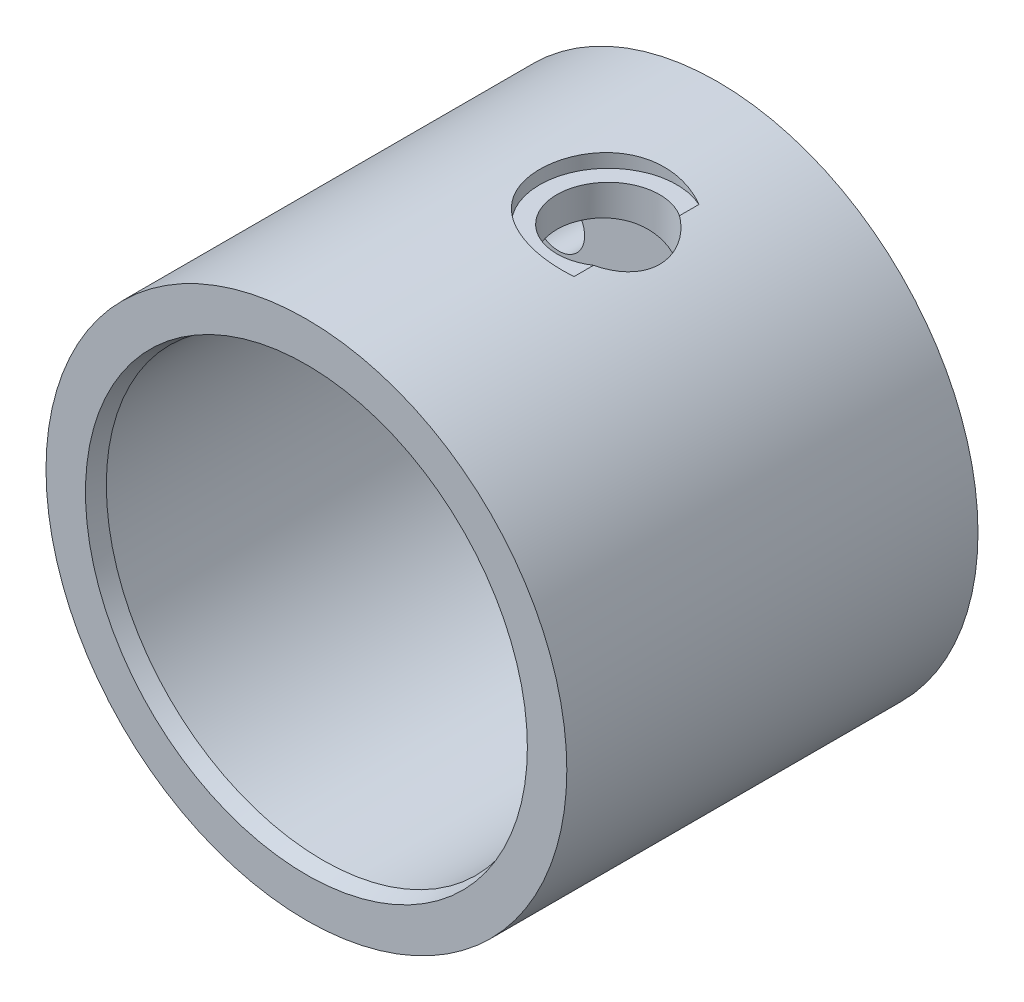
ISO-10303-21;
HEADER;
FILE_DESCRIPTION(('STEP AP214'),'2;1');
FILE_NAME('part.step','',(''),(''),'','','');
FILE_SCHEMA(('AUTOMOTIVE_DESIGN { 1 0 10303 214 1 1 1 1 }'));
ENDSEC;
DATA;
#1=APPLICATION_CONTEXT('core data for automotive mechanical design processes');
#2=APPLICATION_PROTOCOL_DEFINITION('international standard','automotive_design',2000,#1);
#3=PRODUCT_CONTEXT('',#1,'mechanical');
#4=PRODUCT('Part','Part','',(#3));
#5=PRODUCT_RELATED_PRODUCT_CATEGORY('part','',(#4));
#6=PRODUCT_DEFINITION_FORMATION('','',#4);
#7=PRODUCT_DEFINITION_CONTEXT('part definition',#1,'design');
#8=PRODUCT_DEFINITION('design','',#6,#7);
#9=PRODUCT_DEFINITION_SHAPE('','',#8);
#10=(LENGTH_UNIT() NAMED_UNIT(*) SI_UNIT(.MILLI.,.METRE.));
#11=(NAMED_UNIT(*) PLANE_ANGLE_UNIT() SI_UNIT($,.RADIAN.));
#12=(NAMED_UNIT(*) SI_UNIT($,.STERADIAN.) SOLID_ANGLE_UNIT());
#13=UNCERTAINTY_MEASURE_WITH_UNIT(LENGTH_MEASURE(1.E-05),#10,'distance_accuracy_value','');
#14=(GEOMETRIC_REPRESENTATION_CONTEXT(3) GLOBAL_UNCERTAINTY_ASSIGNED_CONTEXT((#13)) GLOBAL_UNIT_ASSIGNED_CONTEXT((#10,
#11,#12)) REPRESENTATION_CONTEXT('',''));
#15=CARTESIAN_POINT('',(0.,0.,0.));
#16=DIRECTION('',(0.,0.,1.));
#17=DIRECTION('',(1.,0.,0.));
#18=AXIS2_PLACEMENT_3D('',#15,#16,#17);
#19=CARTESIAN_POINT('',(0.,0.,-12.7));
#20=DIRECTION('',(0.,0.,1.));
#21=DIRECTION('',(1.,0.,0.));
#22=AXIS2_PLACEMENT_3D('',#19,#20,#21);
#23=CYLINDRICAL_SURFACE('',#22,24.13);
#24=DIRECTION('',(0.,0.,1.));
#25=VECTOR('',#24,1.);
#26=CARTESIAN_POINT('',(7.72510841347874,-22.86,-12.7));
#27=LINE('',#26,#25);
#28=CARTESIAN_POINT('',(7.72510841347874,-22.86,9.45330161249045));
#29=VERTEX_POINT('',#28);
#30=CARTESIAN_POINT('',(7.72510841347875,-22.86,11.25944922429));
#31=VERTEX_POINT('',#30);
#32=EDGE_CURVE('E51',#29,#31,#27,.T.);
#33=ORIENTED_EDGE('',*,*,#32,.F.);
#34=CARTESIAN_POINT('',(7.72510841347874,-22.86,21.0266983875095));
#35=CARTESIAN_POINT('',(7.56332268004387,-22.9146887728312,21.0998120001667));
#36=CARTESIAN_POINT('',(7.39821552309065,-22.9685543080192,21.1662329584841));
#37=CARTESIAN_POINT('',(7.06232493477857,-23.0740386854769,21.2851852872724));
#38=CARTESIAN_POINT('',(6.89154000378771,-23.1256569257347,21.3377129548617));
#39=CARTESIAN_POINT('',(6.54506802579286,-23.2260977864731,21.4284081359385));
#40=CARTESIAN_POINT('',(6.36937350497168,-23.2749157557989,21.46655231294));
#41=CARTESIAN_POINT('',(6.01450393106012,-23.3691318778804,21.5278883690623));
#42=CARTESIAN_POINT('',(5.83532920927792,-23.4145303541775,21.5510816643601));
#43=CARTESIAN_POINT('',(5.47432811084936,-23.5015569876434,21.5821572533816));
#44=CARTESIAN_POINT('',(5.29249682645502,-23.5431767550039,21.5900062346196));
#45=CARTESIAN_POINT('',(4.92791400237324,-23.6221792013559,21.5899937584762));
#46=CARTESIAN_POINT('',(4.74516248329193,-23.6595619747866,21.5821326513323));
#47=CARTESIAN_POINT('',(4.3803689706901,-23.7298068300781,21.5505477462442));
#48=CARTESIAN_POINT('',(4.19832641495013,-23.7626738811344,21.5268415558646));
#49=CARTESIAN_POINT('',(3.83623968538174,-23.8238089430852,21.4635641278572));
#50=CARTESIAN_POINT('',(3.65619541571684,-23.8520771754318,21.423993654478));
#51=CARTESIAN_POINT('',(3.30718407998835,-23.9029121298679,21.3311469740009));
#52=CARTESIAN_POINT('',(3.13807101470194,-23.9256697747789,21.278523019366));
#53=CARTESIAN_POINT('',(2.80439574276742,-23.9670717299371,21.15913596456));
#54=CARTESIAN_POINT('',(2.63983339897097,-23.9857161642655,21.0923732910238));
#55=CARTESIAN_POINT('',(2.31651450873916,-24.0190983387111,20.9451017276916));
#56=CARTESIAN_POINT('',(2.15775954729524,-24.0338350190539,20.8645891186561));
#57=CARTESIAN_POINT('',(1.84735105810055,-24.0596852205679,20.690375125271));
#58=CARTESIAN_POINT('',(1.69569748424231,-24.0707987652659,20.5966738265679));
#59=CARTESIAN_POINT('',(1.40401988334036,-24.0895517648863,20.3990178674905));
#60=CARTESIAN_POINT('',(1.26381006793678,-24.0972643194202,20.2953440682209));
#61=CARTESIAN_POINT('',(0.992272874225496,-24.1099725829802,20.0767136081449));
#62=CARTESIAN_POINT('',(0.860948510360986,-24.1149673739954,19.9617531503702));
#63=CARTESIAN_POINT('',(0.608228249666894,-24.1226644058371,19.721429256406));
#64=CARTESIAN_POINT('',(0.486828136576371,-24.1253676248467,19.5960702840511));
#65=CARTESIAN_POINT('',(0.254701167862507,-24.1289351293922,19.3357259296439));
#66=CARTESIAN_POINT('',(0.143978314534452,-24.129798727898,19.2007369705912));
#67=CARTESIAN_POINT('',(-0.0671054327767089,-24.130140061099,18.9206070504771));
#68=CARTESIAN_POINT('',(-0.167342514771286,-24.1296028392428,18.7753727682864));
#69=CARTESIAN_POINT('',(-0.355416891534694,-24.1275657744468,18.477018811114));
#70=CARTESIAN_POINT('',(-0.443249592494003,-24.126065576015,18.3238962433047));
#71=CARTESIAN_POINT('',(-0.605840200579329,-24.1225303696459,18.0109230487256));
#72=CARTESIAN_POINT('',(-0.680601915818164,-24.1204955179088,17.8510743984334));
#73=CARTESIAN_POINT('',(-0.816590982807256,-24.1162748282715,17.5256531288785));
#74=CARTESIAN_POINT('',(-0.877813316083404,-24.1140889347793,17.3600784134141));
#75=CARTESIAN_POINT('',(-0.986862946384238,-24.1098738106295,17.0225544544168));
#76=CARTESIAN_POINT('',(-1.03453521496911,-24.1078465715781,16.8505550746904));
#77=CARTESIAN_POINT('',(-1.1152527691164,-24.1042474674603,16.5030858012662));
#78=CARTESIAN_POINT('',(-1.14829260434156,-24.1026757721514,16.3276146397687));
#79=CARTESIAN_POINT('',(-1.19947403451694,-24.1001829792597,15.9745762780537));
#80=CARTESIAN_POINT('',(-1.21762129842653,-24.0992616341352,15.7970099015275));
#81=CARTESIAN_POINT('',(-1.2389126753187,-24.0981764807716,15.440910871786));
#82=CARTESIAN_POINT('',(-1.24205118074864,-24.0980129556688,15.2623778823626));
#83=CARTESIAN_POINT('',(-1.23328854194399,-24.0984629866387,14.9057317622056));
#84=CARTESIAN_POINT('',(-1.22139154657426,-24.0990763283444,14.7276185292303));
#85=CARTESIAN_POINT('',(-1.18264147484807,-24.1010089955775,14.3729486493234));
#86=CARTESIAN_POINT('',(-1.15578161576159,-24.1023286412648,14.196392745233));
#87=CARTESIAN_POINT('',(-1.08729210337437,-24.1055153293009,13.8461689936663));
#88=CARTESIAN_POINT('',(-1.04566200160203,-24.1073823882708,13.6725012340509));
#89=CARTESIAN_POINT('',(-0.947950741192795,-24.1114221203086,13.3293685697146));
#90=CARTESIAN_POINT('',(-0.891876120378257,-24.1135946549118,13.1599018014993));
#91=CARTESIAN_POINT('',(-0.765623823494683,-24.1179333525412,12.8261824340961));
#92=CARTESIAN_POINT('',(-0.695437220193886,-24.1200995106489,12.661933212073));
#93=CARTESIAN_POINT('',(-0.541508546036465,-24.124045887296,12.3399854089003));
#94=CARTESIAN_POINT('',(-0.457771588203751,-24.1258262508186,12.182284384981));
#95=CARTESIAN_POINT('',(-0.277281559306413,-24.1285755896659,11.8744278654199));
#96=CARTESIAN_POINT('',(-0.180523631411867,-24.1295442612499,11.7242752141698));
#97=CARTESIAN_POINT('',(0.0252572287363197,-24.1302059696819,11.4327046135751));
#98=CARTESIAN_POINT('',(0.134275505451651,-24.1298994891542,11.2912833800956));
#99=CARTESIAN_POINT('',(0.363784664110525,-24.1275303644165,11.0181751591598));
#100=CARTESIAN_POINT('',(0.484271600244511,-24.1254683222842,10.8864848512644));
#101=CARTESIAN_POINT('',(0.735823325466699,-24.1191061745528,10.63378474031));
#102=CARTESIAN_POINT('',(0.866884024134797,-24.1148069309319,10.5127708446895));
#103=CARTESIAN_POINT('',(1.13870036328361,-24.1035011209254,10.2822025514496));
#104=CARTESIAN_POINT('',(1.27945949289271,-24.0964935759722,10.1726523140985));
#105=CARTESIAN_POINT('',(1.5695077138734,-24.0793404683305,9.96589519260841));
#106=CARTESIAN_POINT('',(1.71879343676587,-24.0691961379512,9.86868348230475));
#107=CARTESIAN_POINT('',(2.02293455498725,-24.0455321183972,9.68834794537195));
#108=CARTESIAN_POINT('',(2.17770042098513,-24.0320548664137,9.60506753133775));
#109=CARTESIAN_POINT('',(2.49324116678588,-24.0013700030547,9.45176569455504));
#110=CARTESIAN_POINT('',(2.65401385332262,-23.9841637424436,9.38173948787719));
#111=CARTESIAN_POINT('',(2.98035675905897,-23.9458004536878,9.25535585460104));
#112=CARTESIAN_POINT('',(3.14592619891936,-23.9246440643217,9.19899622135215));
#113=CARTESIAN_POINT('',(3.48061251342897,-23.8782489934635,9.10023736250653));
#114=CARTESIAN_POINT('',(3.64972929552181,-23.8530104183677,9.05783777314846));
#115=CARTESIAN_POINT('',(3.9886257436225,-23.798675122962,8.98749994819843));
#116=CARTESIAN_POINT('',(4.15838413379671,-23.76961701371,8.95942916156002));
#117=CARTESIAN_POINT('',(4.49889825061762,-23.7075255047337,8.91718561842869));
#118=CARTESIAN_POINT('',(4.66965398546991,-23.6744920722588,8.90301297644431));
#119=CARTESIAN_POINT('',(5.01111681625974,-23.6045759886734,8.88847504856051));
#120=CARTESIAN_POINT('',(5.18182373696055,-23.5676899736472,8.88812193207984));
#121=CARTESIAN_POINT('',(5.52184421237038,-23.4903496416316,8.90105983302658));
#122=CARTESIAN_POINT('',(5.69115820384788,-23.4498964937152,8.91434639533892));
#123=CARTESIAN_POINT('',(6.02163768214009,-23.3671735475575,8.95359307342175));
#124=CARTESIAN_POINT('',(6.18288406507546,-23.3250128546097,8.97910522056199));
#125=CARTESIAN_POINT('',(6.50224738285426,-23.2380093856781,9.04227454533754));
#126=CARTESIAN_POINT('',(6.6603642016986,-23.1931665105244,9.07993217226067));
#127=CARTESIAN_POINT('',(6.97239338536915,-23.1012772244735,9.1669672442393));
#128=CARTESIAN_POINT('',(7.1263118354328,-23.0542343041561,9.21632659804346));
#129=CARTESIAN_POINT('',(7.42942835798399,-22.9583512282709,9.32639761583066));
#130=CARTESIAN_POINT('',(7.57862722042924,-22.9095113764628,9.38710736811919));
#131=CARTESIAN_POINT('',(7.72510841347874,-22.86,9.45330161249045));
#132=B_SPLINE_CURVE_WITH_KNOTS('',3,(#34,#35,#36,#37,#38,#39,#40,#41,#42,#43,#44,#45,#46,#47,
#48,#49,#50,#51,#52,#53,#54,#55,#56,#57,#58,#59,#60,#61,#62,#63,#64,#65,#66,#67,#68,#69,#70,#71,
#72,#73,#74,#75,#76,#77,#78,#79,#80,#81,#82,#83,#84,#85,#86,#87,#88,#89,#90,#91,#92,#93,#94,#95,
#96,#97,#98,#99,#100,#101,#102,#103,#104,#105,#106,#107,#108,#109,#110,#111,#112,#113,#114,#115,
#116,#117,#118,#119,#120,#121,#122,#123,#124,#125,#126,#127,#128,#129,#130,#131),.UNSPECIFIED.,
.F.,.F.,(4,2,2,2,2,2,2,2,2,2,2,2,2,2,2,2,2,2,2,2,2,2,2,2,2,2,2,2,2,2,2,2,2,2,2,2,2,2,2,2,2,2,2,
2,2,2,2,2,4),(0.,0.55718858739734,1.11452552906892,1.67276287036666,2.2309473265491,
2.79034226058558,3.34972472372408,3.90848661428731,4.46722159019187,5.0022664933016,
5.537295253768,6.07246896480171,6.60763920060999,7.13066747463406,7.65387230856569,
8.17685369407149,8.70003035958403,9.22881579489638,9.75779654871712,10.2866229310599,
10.8156449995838,11.3504961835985,11.8855464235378,12.4203928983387,12.9554391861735,
13.4903378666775,14.0254792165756,14.5606368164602,15.0955526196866,15.6308078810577,
16.1658616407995,16.7011155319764,17.2361668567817,17.7710347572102,18.3056967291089,
18.8405520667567,19.375197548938,19.9033575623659,20.4313265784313,20.9592102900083,
21.4870802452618,22.0099742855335,22.5328726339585,23.0562314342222,23.5794193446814,
24.0847530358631,24.5901054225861,25.0946815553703,25.5991727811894),.UNSPECIFIED.);
#133=CARTESIAN_POINT('',(7.72510841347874,-22.86,21.0266983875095));
#134=VERTEX_POINT('',#133);
#135=EDGE_CURVE('E89',#134,#29,#132,.T.);
#136=ORIENTED_EDGE('',*,*,#135,.F.);
#137=CARTESIAN_POINT('',(7.72510841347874,-22.86,19.22055077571));
#138=VERTEX_POINT('',#137);
#139=EDGE_CURVE('E77',#138,#134,#27,.T.);
#140=ORIENTED_EDGE('',*,*,#139,.F.);
#141=CARTESIAN_POINT('',(5.110414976,-23.5826325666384,20.0025));
#142=CARTESIAN_POINT('',(4.84833308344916,-23.6394231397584,20.0024933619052));
#143=CARTESIAN_POINT('',(4.58521386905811,-23.6918277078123,19.9808070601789));
#144=CARTESIAN_POINT('',(4.06437700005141,-23.7867166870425,19.8937037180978));
#145=CARTESIAN_POINT('',(3.80666121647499,-23.8291977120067,19.828271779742));
#146=CARTESIAN_POINT('',(3.30424687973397,-23.9040463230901,19.6547283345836));
#147=CARTESIAN_POINT('',(3.05955688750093,-23.9364073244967,19.5465891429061));
#148=CARTESIAN_POINT('',(2.59095079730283,-23.9916571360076,19.2903109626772));
#149=CARTESIAN_POINT('',(2.36703319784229,-24.0145466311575,19.1421748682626));
#150=CARTESIAN_POINT('',(1.94946930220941,-24.0520260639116,18.8120845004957));
#151=CARTESIAN_POINT('',(1.75548185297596,-24.0667154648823,18.6305726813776));
#152=CARTESIAN_POINT('',(1.40019330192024,-24.0900007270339,18.2376361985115));
#153=CARTESIAN_POINT('',(1.23889282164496,-24.0985964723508,18.0262109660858));
#154=CARTESIAN_POINT('',(0.953268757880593,-24.1115894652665,17.5788363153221));
#155=CARTESIAN_POINT('',(0.829040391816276,-24.115975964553,17.3428258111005));
#156=CARTESIAN_POINT('',(0.621642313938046,-24.1222155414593,16.8533741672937));
#157=CARTESIAN_POINT('',(0.538473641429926,-24.1240685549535,16.599932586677));
#158=CARTESIAN_POINT('',(0.415186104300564,-24.1265079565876,16.0812451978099));
#159=CARTESIAN_POINT('',(0.375315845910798,-24.1270870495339,15.815940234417));
#160=CARTESIAN_POINT('',(0.34060581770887,-24.1276024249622,15.2823990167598));
#161=CARTESIAN_POINT('',(0.345766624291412,-24.1275386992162,15.0141627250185));
#162=CARTESIAN_POINT('',(0.401015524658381,-24.1266830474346,14.4819453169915));
#163=CARTESIAN_POINT('',(0.451171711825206,-24.1258900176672,14.217971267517));
#164=CARTESIAN_POINT('',(0.595081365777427,-24.1227675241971,13.7021919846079));
#165=CARTESIAN_POINT('',(0.688835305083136,-24.1204380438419,13.4503868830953));
#166=CARTESIAN_POINT('',(0.917217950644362,-24.1128304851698,12.9662096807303));
#167=CARTESIAN_POINT('',(1.05183122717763,-24.1075535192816,12.7338302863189));
#168=CARTESIAN_POINT('',(1.35804926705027,-24.0922398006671,12.2950511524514));
#169=CARTESIAN_POINT('',(1.52965286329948,-24.0822031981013,12.0886505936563));
#170=CARTESIAN_POINT('',(1.90406411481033,-24.0554867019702,11.7084814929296));
#171=CARTESIAN_POINT('',(2.10674969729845,-24.0388324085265,11.534590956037));
#172=CARTESIAN_POINT('',(2.53770663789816,-23.9971606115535,11.2233832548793));
#173=CARTESIAN_POINT('',(2.76597606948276,-23.9721437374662,11.0860633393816));
#174=CARTESIAN_POINT('',(3.23971783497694,-23.9127102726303,10.8523761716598));
#175=CARTESIAN_POINT('',(3.4850782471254,-23.8783512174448,10.7557671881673));
#176=CARTESIAN_POINT('',(3.98686836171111,-23.7997109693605,10.6045143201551));
#177=CARTESIAN_POINT('',(4.24329817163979,-23.7554296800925,10.5498708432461));
#178=CARTESIAN_POINT('',(4.76164232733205,-23.6570017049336,10.4830533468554));
#179=CARTESIAN_POINT('',(5.02358260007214,-23.6027876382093,10.4711815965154));
#180=CARTESIAN_POINT('',(5.54401248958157,-23.4859958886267,10.4901326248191));
#181=CARTESIAN_POINT('',(5.80250154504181,-23.4234168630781,10.5209622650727));
#182=CARTESIAN_POINT('',(6.31766717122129,-23.2898487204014,10.6253242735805));
#183=CARTESIAN_POINT('',(6.57401799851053,-23.2186538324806,10.7001983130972));
#184=CARTESIAN_POINT('',(7.06979941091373,-23.0725315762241,10.891113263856));
#185=CARTESIAN_POINT('',(7.30922544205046,-22.9976032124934,11.0071652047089));
#186=CARTESIAN_POINT('',(7.77445661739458,-22.8446287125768,11.2826939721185));
#187=CARTESIAN_POINT('',(7.99935247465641,-22.7665761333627,11.4437025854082));
#188=CARTESIAN_POINT('',(8.41891789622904,-22.6147856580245,11.8032235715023));
#189=CARTESIAN_POINT('',(8.61358255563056,-22.5410484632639,12.0017420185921));
#190=CARTESIAN_POINT('',(8.8783637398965,-22.4374824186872,12.3239416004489));
#191=CARTESIAN_POINT('',(8.96214988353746,-22.4041074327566,12.4355207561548));
#192=CARTESIAN_POINT('',(9.11994126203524,-22.3403400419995,12.6661711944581));
#193=CARTESIAN_POINT('',(9.19395091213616,-22.3099462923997,12.7852390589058));
#194=CARTESIAN_POINT('',(9.33149519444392,-22.2527673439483,13.0301092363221));
#195=CARTESIAN_POINT('',(9.39502921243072,-22.2259823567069,13.1559119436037));
#196=CARTESIAN_POINT('',(9.51092083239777,-22.1766375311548,13.4132935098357));
#197=CARTESIAN_POINT('',(9.5632842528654,-22.1540754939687,13.5448693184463));
#198=CARTESIAN_POINT('',(9.653303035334,-22.114992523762,13.8043072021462));
#199=CARTESIAN_POINT('',(9.69168114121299,-22.0981789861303,13.931874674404));
#200=CARTESIAN_POINT('',(9.75768470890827,-22.0691139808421,14.1902130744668));
#201=CARTESIAN_POINT('',(9.78531528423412,-22.0568603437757,14.3209824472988));
#202=CARTESIAN_POINT('',(9.82951096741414,-22.0372003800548,14.5847054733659));
#203=CARTESIAN_POINT('',(9.84607886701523,-22.0297928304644,14.717658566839));
#204=CARTESIAN_POINT('',(9.86795140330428,-22.0200041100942,14.9846700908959));
#205=CARTESIAN_POINT('',(9.8732566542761,-22.0176226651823,15.1187284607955));
#206=CARTESIAN_POINT('',(9.87256563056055,-22.0179323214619,15.3768839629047));
#207=CARTESIAN_POINT('',(9.86737614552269,-22.0202613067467,15.5009845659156));
#208=CARTESIAN_POINT('',(9.84733832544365,-22.0292294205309,15.748288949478));
#209=CARTESIAN_POINT('',(9.83248680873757,-22.0358699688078,15.8714924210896));
#210=CARTESIAN_POINT('',(9.79328941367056,-22.0533181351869,16.1160256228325));
#211=CARTESIAN_POINT('',(9.76894737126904,-22.0641240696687,16.2373560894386));
#212=CARTESIAN_POINT('',(9.71101112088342,-22.0896845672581,16.4774064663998));
#213=CARTESIAN_POINT('',(9.67741340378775,-22.10444062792,16.596125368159));
#214=CARTESIAN_POINT('',(9.60146776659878,-22.1375342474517,16.829606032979));
#215=CARTESIAN_POINT('',(9.55916069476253,-22.1558550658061,16.9443834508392));
#216=CARTESIAN_POINT('',(9.46608609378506,-22.195780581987,17.1698797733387));
#217=CARTESIAN_POINT('',(9.41531555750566,-22.2173864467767,17.2805972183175));
#218=CARTESIAN_POINT('',(9.25093592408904,-22.2865707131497,17.6056608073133));
#219=CARTESIAN_POINT('',(9.12520081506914,-22.3385416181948,17.813094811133));
#220=CARTESIAN_POINT('',(8.83593735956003,-22.454596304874,18.2178975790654));
#221=CARTESIAN_POINT('',(8.67046351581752,-22.519252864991,18.4137004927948));
#222=CARTESIAN_POINT('',(8.31146422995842,-22.6542098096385,18.7754858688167));
#223=CARTESIAN_POINT('',(8.11792449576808,-22.7245130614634,18.9414530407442));
#224=CARTESIAN_POINT('',(7.69246872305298,-22.8721897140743,19.2510527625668));
#225=CARTESIAN_POINT('',(7.45878835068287,-22.9497063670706,19.3921966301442));
#226=CARTESIAN_POINT('',(6.97034547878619,-23.102738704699,19.6327318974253));
#227=CARTESIAN_POINT('',(6.71559378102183,-23.1782553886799,19.7321445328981));
#228=CARTESIAN_POINT('',(6.23695866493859,-23.3111107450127,19.872851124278));
#229=CARTESIAN_POINT('',(6.01537947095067,-23.3693312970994,19.9212325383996));
#230=CARTESIAN_POINT('',(5.56626708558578,-23.4803545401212,19.9860578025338));
#231=CARTESIAN_POINT('',(5.33873466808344,-23.5331579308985,20.0025057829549));
#232=CARTESIAN_POINT('',(5.110414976,-23.5826325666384,20.0025));
#233=B_SPLINE_CURVE_WITH_KNOTS('',3,(#141,#142,#143,#144,#145,#146,#147,#148,#149,#150,#151,
#152,#153,#154,#155,#156,#157,#158,#159,#160,#161,#162,#163,#164,#165,#166,#167,#168,#169,#170,
#171,#172,#173,#174,#175,#176,#177,#178,#179,#180,#181,#182,#183,#184,#185,#186,#187,#188,#189,
#190,#191,#192,#193,#194,#195,#196,#197,#198,#199,#200,#201,#202,#203,#204,#205,#206,#207,#208,
#209,#210,#211,#212,#213,#214,#215,#216,#217,#218,#219,#220,#221,#222,#223,#224,#225,#226,#227,
#228,#229,#230,#231,#232),.UNSPECIFIED.,.T.,.F.,(4,2,2,2,2,2,2,2,2,2,2,2,2,2,2,2,2,2,2,2,2,2,2,
2,2,2,2,2,2,2,2,2,2,2,2,2,2,2,2,2,2,2,2,2,2,4),(0.,0.803690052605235,1.60765394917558,
2.41213987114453,3.21656759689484,4.01101330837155,4.80547412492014,5.60195824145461,
6.39846251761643,7.19951628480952,8.00058030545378,8.80285865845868,9.60514570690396,
10.4071301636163,11.2090893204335,12.007975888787,12.8068023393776,13.6008163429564,
14.3948380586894,15.1944602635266,15.9942109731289,16.8196863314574,17.6453829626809,
18.5036361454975,19.3620284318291,19.7919819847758,20.2217406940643,20.6515245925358,
21.0810840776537,21.4833705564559,21.8854653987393,22.287458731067,22.689430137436,
23.0616736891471,23.4340398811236,23.8062557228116,24.1786128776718,24.5492618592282,
24.9200428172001,25.6610481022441,26.450919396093,27.2411943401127,28.0887140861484,
28.9358020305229,29.6360488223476,30.3362050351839),.UNSPECIFIED.);
#234=EDGE_CURVE('E127',#31,#138,#233,.T.);
#235=ORIENTED_EDGE('',*,*,#234,.F.);
#236=EDGE_LOOP('',(#33,#136,#140,#235));
#237=FACE_BOUND('',#236,.T.);
#238=CARTESIAN_POINT('',(0.,0.,0.));
#239=DIRECTION('',(0.,0.,1.));
#240=DIRECTION('',(1.,0.,0.));
#241=AXIS2_PLACEMENT_3D('',#238,#239,#240);
#242=CIRCLE('',#241,24.13);
#243=CARTESIAN_POINT('',(24.13,0.,0.));
#244=VERTEX_POINT('',#243);
#245=EDGE_CURVE('E138',#244,#244,#242,.T.);
#246=ORIENTED_EDGE('',*,*,#245,.T.);
#247=EDGE_LOOP('',(#246));
#248=FACE_BOUND('',#247,.T.);
#249=CARTESIAN_POINT('',(0.,0.,38.1));
#250=DIRECTION('',(0.,0.,1.));
#251=DIRECTION('',(1.,0.,0.));
#252=AXIS2_PLACEMENT_3D('',#249,#250,#251);
#253=CIRCLE('',#252,24.13);
#254=CARTESIAN_POINT('',(24.13,0.,38.1));
#255=VERTEX_POINT('',#254);
#256=EDGE_CURVE('E142',#255,#255,#253,.T.);
#257=ORIENTED_EDGE('',*,*,#256,.F.);
#258=EDGE_LOOP('',(#257));
#259=FACE_BOUND('',#258,.T.);
#260=CARTESIAN_POINT('',(7.72510841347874,22.86,21.0266983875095));
#261=CARTESIAN_POINT('',(7.56332268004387,22.9146887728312,21.0998120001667));
#262=CARTESIAN_POINT('',(7.39821552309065,22.9685543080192,21.1662329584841));
#263=CARTESIAN_POINT('',(7.06232493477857,23.0740386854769,21.2851852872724));
#264=CARTESIAN_POINT('',(6.89154000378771,23.1256569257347,21.3377129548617));
#265=CARTESIAN_POINT('',(6.54506802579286,23.2260977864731,21.4284081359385));
#266=CARTESIAN_POINT('',(6.36937350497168,23.2749157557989,21.46655231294));
#267=CARTESIAN_POINT('',(6.01450393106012,23.3691318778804,21.5278883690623));
#268=CARTESIAN_POINT('',(5.83532920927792,23.4145303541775,21.5510816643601));
#269=CARTESIAN_POINT('',(5.47432811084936,23.5015569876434,21.5821572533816));
#270=CARTESIAN_POINT('',(5.29249682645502,23.5431767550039,21.5900062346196));
#271=CARTESIAN_POINT('',(4.92791400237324,23.6221792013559,21.5899937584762));
#272=CARTESIAN_POINT('',(4.74516248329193,23.6595619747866,21.5821326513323));
#273=CARTESIAN_POINT('',(4.3803689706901,23.7298068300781,21.5505477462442));
#274=CARTESIAN_POINT('',(4.19832641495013,23.7626738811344,21.5268415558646));
#275=CARTESIAN_POINT('',(3.83623968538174,23.8238089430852,21.4635641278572));
#276=CARTESIAN_POINT('',(3.65619541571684,23.8520771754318,21.423993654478));
#277=CARTESIAN_POINT('',(3.30718407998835,23.9029121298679,21.3311469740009));
#278=CARTESIAN_POINT('',(3.13807101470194,23.9256697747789,21.278523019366));
#279=CARTESIAN_POINT('',(2.80439574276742,23.9670717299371,21.15913596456));
#280=CARTESIAN_POINT('',(2.63983339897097,23.9857161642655,21.0923732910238));
#281=CARTESIAN_POINT('',(2.31651450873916,24.0190983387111,20.9451017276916));
#282=CARTESIAN_POINT('',(2.15775954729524,24.0338350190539,20.8645891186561));
#283=CARTESIAN_POINT('',(1.84735105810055,24.0596852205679,20.690375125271));
#284=CARTESIAN_POINT('',(1.69569748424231,24.0707987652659,20.5966738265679));
#285=CARTESIAN_POINT('',(1.40401988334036,24.0895517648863,20.3990178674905));
#286=CARTESIAN_POINT('',(1.26381006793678,24.0972643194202,20.2953440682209));
#287=CARTESIAN_POINT('',(0.992272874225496,24.1099725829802,20.0767136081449));
#288=CARTESIAN_POINT('',(0.860948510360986,24.1149673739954,19.9617531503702));
#289=CARTESIAN_POINT('',(0.608228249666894,24.1226644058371,19.721429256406));
#290=CARTESIAN_POINT('',(0.486828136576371,24.1253676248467,19.5960702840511));
#291=CARTESIAN_POINT('',(0.254701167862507,24.1289351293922,19.3357259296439));
#292=CARTESIAN_POINT('',(0.143978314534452,24.129798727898,19.2007369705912));
#293=CARTESIAN_POINT('',(-0.0671054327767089,24.130140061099,18.9206070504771));
#294=CARTESIAN_POINT('',(-0.167342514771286,24.1296028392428,18.7753727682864));
#295=CARTESIAN_POINT('',(-0.355416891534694,24.1275657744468,18.477018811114));
#296=CARTESIAN_POINT('',(-0.443249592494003,24.126065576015,18.3238962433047));
#297=CARTESIAN_POINT('',(-0.605840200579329,24.1225303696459,18.0109230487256));
#298=CARTESIAN_POINT('',(-0.680601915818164,24.1204955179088,17.8510743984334));
#299=CARTESIAN_POINT('',(-0.816590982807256,24.1162748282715,17.5256531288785));
#300=CARTESIAN_POINT('',(-0.877813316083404,24.1140889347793,17.3600784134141));
#301=CARTESIAN_POINT('',(-0.986862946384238,24.1098738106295,17.0225544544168));
#302=CARTESIAN_POINT('',(-1.03453521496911,24.1078465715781,16.8505550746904));
#303=CARTESIAN_POINT('',(-1.1152527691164,24.1042474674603,16.5030858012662));
#304=CARTESIAN_POINT('',(-1.14829260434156,24.1026757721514,16.3276146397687));
#305=CARTESIAN_POINT('',(-1.19947403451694,24.1001829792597,15.9745762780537));
#306=CARTESIAN_POINT('',(-1.21762129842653,24.0992616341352,15.7970099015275));
#307=CARTESIAN_POINT('',(-1.2389126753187,24.0981764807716,15.440910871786));
#308=CARTESIAN_POINT('',(-1.24205118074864,24.0980129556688,15.2623778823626));
#309=CARTESIAN_POINT('',(-1.23328854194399,24.0984629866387,14.9057317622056));
#310=CARTESIAN_POINT('',(-1.22139154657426,24.0990763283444,14.7276185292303));
#311=CARTESIAN_POINT('',(-1.18264147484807,24.1010089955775,14.3729486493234));
#312=CARTESIAN_POINT('',(-1.15578161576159,24.1023286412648,14.196392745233));
#313=CARTESIAN_POINT('',(-1.08729210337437,24.1055153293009,13.8461689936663));
#314=CARTESIAN_POINT('',(-1.04566200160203,24.1073823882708,13.6725012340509));
#315=CARTESIAN_POINT('',(-0.947950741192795,24.1114221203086,13.3293685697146));
#316=CARTESIAN_POINT('',(-0.891876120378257,24.1135946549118,13.1599018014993));
#317=CARTESIAN_POINT('',(-0.765623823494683,24.1179333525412,12.8261824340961));
#318=CARTESIAN_POINT('',(-0.695437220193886,24.1200995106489,12.661933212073));
#319=CARTESIAN_POINT('',(-0.541508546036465,24.124045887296,12.3399854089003));
#320=CARTESIAN_POINT('',(-0.457771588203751,24.1258262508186,12.182284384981));
#321=CARTESIAN_POINT('',(-0.277281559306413,24.1285755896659,11.8744278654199));
#322=CARTESIAN_POINT('',(-0.180523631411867,24.1295442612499,11.7242752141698));
#323=CARTESIAN_POINT('',(0.0252572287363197,24.1302059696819,11.4327046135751));
#324=CARTESIAN_POINT('',(0.134275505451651,24.1298994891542,11.2912833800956));
#325=CARTESIAN_POINT('',(0.363784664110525,24.1275303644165,11.0181751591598));
#326=CARTESIAN_POINT('',(0.484271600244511,24.1254683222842,10.8864848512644));
#327=CARTESIAN_POINT('',(0.735823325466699,24.1191061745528,10.63378474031));
#328=CARTESIAN_POINT('',(0.866884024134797,24.1148069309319,10.5127708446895));
#329=CARTESIAN_POINT('',(1.13870036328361,24.1035011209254,10.2822025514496));
#330=CARTESIAN_POINT('',(1.27945949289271,24.0964935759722,10.1726523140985));
#331=CARTESIAN_POINT('',(1.5695077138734,24.0793404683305,9.96589519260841));
#332=CARTESIAN_POINT('',(1.71879343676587,24.0691961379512,9.86868348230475));
#333=CARTESIAN_POINT('',(2.02293455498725,24.0455321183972,9.68834794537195));
#334=CARTESIAN_POINT('',(2.17770042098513,24.0320548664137,9.60506753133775));
#335=CARTESIAN_POINT('',(2.49324116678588,24.0013700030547,9.45176569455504));
#336=CARTESIAN_POINT('',(2.65401385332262,23.9841637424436,9.38173948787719));
#337=CARTESIAN_POINT('',(2.98035675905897,23.9458004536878,9.25535585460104));
#338=CARTESIAN_POINT('',(3.14592619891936,23.9246440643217,9.19899622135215));
#339=CARTESIAN_POINT('',(3.48061251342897,23.8782489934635,9.10023736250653));
#340=CARTESIAN_POINT('',(3.64972929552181,23.8530104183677,9.05783777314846));
#341=CARTESIAN_POINT('',(3.9886257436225,23.798675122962,8.98749994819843));
#342=CARTESIAN_POINT('',(4.15838413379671,23.76961701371,8.95942916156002));
#343=CARTESIAN_POINT('',(4.49889825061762,23.7075255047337,8.91718561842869));
#344=CARTESIAN_POINT('',(4.66965398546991,23.6744920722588,8.90301297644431));
#345=CARTESIAN_POINT('',(5.01111681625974,23.6045759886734,8.88847504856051));
#346=CARTESIAN_POINT('',(5.18182373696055,23.5676899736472,8.88812193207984));
#347=CARTESIAN_POINT('',(5.52184421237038,23.4903496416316,8.90105983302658));
#348=CARTESIAN_POINT('',(5.69115820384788,23.4498964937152,8.91434639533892));
#349=CARTESIAN_POINT('',(6.02163768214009,23.3671735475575,8.95359307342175));
#350=CARTESIAN_POINT('',(6.18288406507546,23.3250128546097,8.97910522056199));
#351=CARTESIAN_POINT('',(6.50224738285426,23.2380093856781,9.04227454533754));
#352=CARTESIAN_POINT('',(6.6603642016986,23.1931665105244,9.07993217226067));
#353=CARTESIAN_POINT('',(6.97239338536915,23.1012772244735,9.1669672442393));
#354=CARTESIAN_POINT('',(7.1263118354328,23.0542343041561,9.21632659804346));
#355=CARTESIAN_POINT('',(7.42942835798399,22.9583512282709,9.32639761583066));
#356=CARTESIAN_POINT('',(7.57862722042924,22.9095113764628,9.38710736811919));
#357=CARTESIAN_POINT('',(7.72510841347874,22.86,9.45330161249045));
#358=B_SPLINE_CURVE_WITH_KNOTS('',3,(#260,#261,#262,#263,#264,#265,#266,#267,#268,#269,#270,
#271,#272,#273,#274,#275,#276,#277,#278,#279,#280,#281,#282,#283,#284,#285,#286,#287,#288,#289,
#290,#291,#292,#293,#294,#295,#296,#297,#298,#299,#300,#301,#302,#303,#304,#305,#306,#307,#308,
#309,#310,#311,#312,#313,#314,#315,#316,#317,#318,#319,#320,#321,#322,#323,#324,#325,#326,#327,
#328,#329,#330,#331,#332,#333,#334,#335,#336,#337,#338,#339,#340,#341,#342,#343,#344,#345,#346,
#347,#348,#349,#350,#351,#352,#353,#354,#355,#356,#357),.UNSPECIFIED.,.F.,.F.,(4,2,2,2,2,2,2,2,
2,2,2,2,2,2,2,2,2,2,2,2,2,2,2,2,2,2,2,2,2,2,2,2,2,2,2,2,2,2,2,2,2,2,2,2,2,2,2,2,4),(0.,
0.55718858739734,1.11452552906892,1.67276287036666,2.2309473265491,2.79034226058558,
3.34972472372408,3.90848661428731,4.46722159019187,5.0022664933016,5.537295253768,
6.07246896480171,6.60763920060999,7.13066747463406,7.65387230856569,8.17685369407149,
8.70003035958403,9.22881579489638,9.75779654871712,10.2866229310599,10.8156449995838,
11.3504961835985,11.8855464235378,12.4203928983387,12.9554391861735,13.4903378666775,
14.0254792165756,14.5606368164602,15.0955526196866,15.6308078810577,16.1658616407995,
16.7011155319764,17.2361668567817,17.7710347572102,18.3056967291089,18.8405520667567,
19.375197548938,19.9033575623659,20.4313265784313,20.9592102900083,21.4870802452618,
22.0099742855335,22.5328726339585,23.0562314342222,23.5794193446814,24.0847530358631,
24.5901054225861,25.0946815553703,25.5991727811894),.UNSPECIFIED.);
#359=CARTESIAN_POINT('',(7.72510841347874,22.86,21.0266983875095));
#360=VERTEX_POINT('',#359);
#361=CARTESIAN_POINT('',(7.72510841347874,22.86,9.45330161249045));
#362=VERTEX_POINT('',#361);
#363=EDGE_CURVE('E94',#360,#362,#358,.T.);
#364=ORIENTED_EDGE('',*,*,#363,.T.);
#365=DIRECTION('',(0.,0.,1.));
#366=VECTOR('',#365,1.);
#367=CARTESIAN_POINT('',(7.72510841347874,22.86,-12.7));
#368=LINE('',#367,#366);
#369=CARTESIAN_POINT('',(7.72510841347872,22.86,11.25944922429));
#370=VERTEX_POINT('',#369);
#371=EDGE_CURVE('E137',#362,#370,#368,.T.);
#372=ORIENTED_EDGE('',*,*,#371,.T.);
#373=CARTESIAN_POINT('',(5.110414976,23.5826325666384,20.0025));
#374=CARTESIAN_POINT('',(5.24861747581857,23.5526845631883,20.0025014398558));
#375=CARTESIAN_POINT('',(5.386532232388,23.5215227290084,19.996482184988));
#376=CARTESIAN_POINT('',(5.66086186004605,23.4570115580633,19.9725860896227));
#377=CARTESIAN_POINT('',(5.79727631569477,23.4236616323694,19.9547060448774));
#378=CARTESIAN_POINT('',(6.06771853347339,23.3550674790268,19.9073164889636));
#379=CARTESIAN_POINT('',(6.20174393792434,23.3198215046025,19.8777960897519));
#380=CARTESIAN_POINT('',(6.46642738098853,23.2478178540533,19.8074277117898));
#381=CARTESIAN_POINT('',(6.59708410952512,23.2110596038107,19.7665753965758));
#382=CARTESIAN_POINT('',(6.85384341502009,23.1365417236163,19.6740102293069));
#383=CARTESIAN_POINT('',(6.97995541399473,23.0987844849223,19.6223215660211));
#384=CARTESIAN_POINT('',(7.22717813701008,23.0226308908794,19.5084014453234));
#385=CARTESIAN_POINT('',(7.34828713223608,22.9842343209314,19.4461663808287));
#386=CARTESIAN_POINT('',(7.58467313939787,22.9073149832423,19.3116022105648));
#387=CARTESIAN_POINT('',(7.6999516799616,22.8687922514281,19.2392757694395));
#388=CARTESIAN_POINT('',(7.92398614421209,22.7921337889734,19.0849609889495));
#389=CARTESIAN_POINT('',(8.0327420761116,22.7539980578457,19.0029726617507));
#390=CARTESIAN_POINT('',(8.24531459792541,22.6778462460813,18.8279210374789));
#391=CARTESIAN_POINT('',(8.3489723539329,22.6398508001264,18.7346556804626));
#392=CARTESIAN_POINT('',(8.54796006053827,22.5654727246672,18.5391121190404));
#393=CARTESIAN_POINT('',(8.64329314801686,22.5290894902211,18.4368373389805));
#394=CARTESIAN_POINT('',(8.82497581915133,22.458544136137,18.2237979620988));
#395=CARTESIAN_POINT('',(8.91132150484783,22.4243829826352,18.1130297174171));
#396=CARTESIAN_POINT('',(9.07420597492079,22.3589666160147,17.8837716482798));
#397=CARTESIAN_POINT('',(9.15074942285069,22.3277100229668,17.7652855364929));
#398=CARTESIAN_POINT('',(9.29129652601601,22.2695830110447,17.5248339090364));
#399=CARTESIAN_POINT('',(9.35559768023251,22.2426122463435,17.4030666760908));
#400=CARTESIAN_POINT('',(9.47364240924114,22.1925913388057,17.1538071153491));
#401=CARTESIAN_POINT('',(9.52739085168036,22.1695393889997,17.0263174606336));
#402=CARTESIAN_POINT('',(9.62375795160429,22.1278770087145,16.7665408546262));
#403=CARTESIAN_POINT('',(9.66638039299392,22.1092650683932,16.6342555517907));
#404=CARTESIAN_POINT('',(9.74000361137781,22.0769302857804,16.3659074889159));
#405=CARTESIAN_POINT('',(9.77100536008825,22.0632070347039,16.2298450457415));
#406=CARTESIAN_POINT('',(9.8190018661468,22.0418858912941,15.9660409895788));
#407=CARTESIAN_POINT('',(9.83691434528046,22.0338877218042,15.8384979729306));
#408=CARTESIAN_POINT('',(9.86235183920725,22.0225137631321,15.5821781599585));
#409=CARTESIAN_POINT('',(9.86987747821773,22.0191376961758,15.453401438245));
#410=CARTESIAN_POINT('',(9.87445203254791,22.0170866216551,15.1956581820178));
#411=CARTESIAN_POINT('',(9.87150364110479,22.0184104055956,15.0666917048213));
#412=CARTESIAN_POINT('',(9.85517243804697,22.0257248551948,14.8095580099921));
#413=CARTESIAN_POINT('',(9.8417898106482,22.0317154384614,14.681390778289));
#414=CARTESIAN_POINT('',(9.80565741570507,22.0478197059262,14.4331230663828));
#415=CARTESIAN_POINT('',(9.7834019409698,22.0577155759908,14.3129363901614));
#416=CARTESIAN_POINT('',(9.72983377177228,22.0813966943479,14.0749784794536));
#417=CARTESIAN_POINT('',(9.69851813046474,22.0951832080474,13.9572080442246));
#418=CARTESIAN_POINT('',(9.59141193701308,22.1419934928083,13.6087451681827));
#419=CARTESIAN_POINT('',(9.50242996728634,22.1804827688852,13.3826837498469));
#420=CARTESIAN_POINT('',(9.28902254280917,22.2707142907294,12.9415825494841));
#421=CARTESIAN_POINT('',(9.16353505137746,22.3228480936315,12.7271433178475));
#422=CARTESIAN_POINT('',(8.88223981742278,22.4362583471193,12.3218473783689));
#423=CARTESIAN_POINT('',(8.72642186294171,22.4975378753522,12.1309986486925));
#424=CARTESIAN_POINT('',(8.37525632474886,22.6307280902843,11.7626582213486));
#425=CARTESIAN_POINT('',(8.17777514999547,22.7030950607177,11.5873646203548));
#426=CARTESIAN_POINT('',(7.75719893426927,22.8502165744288,11.2719935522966));
#427=CARTESIAN_POINT('',(7.53409545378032,22.9249718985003,11.1319277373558));
#428=CARTESIAN_POINT('',(7.05502731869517,23.0770417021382,10.8838041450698));
#429=CARTESIAN_POINT('',(6.79794540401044,23.15428046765,10.7778480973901));
#430=CARTESIAN_POINT('',(6.26783093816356,23.3033678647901,10.6119426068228));
#431=CARTESIAN_POINT('',(5.99479872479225,23.3752166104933,10.5519921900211));
#432=CARTESIAN_POINT('',(5.44249127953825,23.5099196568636,10.4810053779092));
#433=CARTESIAN_POINT('',(5.16328040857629,23.5728390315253,10.4695954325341));
#434=CARTESIAN_POINT('',(4.60504249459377,23.6882175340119,10.4961593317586));
#435=CARTESIAN_POINT('',(4.32601542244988,23.7406794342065,10.5341200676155));
#436=CARTESIAN_POINT('',(3.78853816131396,23.8322303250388,10.6566734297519));
#437=CARTESIAN_POINT('',(3.5297137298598,23.871780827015,10.7392825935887));
#438=CARTESIAN_POINT('',(3.02874641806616,23.9405000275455,10.9479549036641));
#439=CARTESIAN_POINT('',(2.78660094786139,23.9696703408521,11.0740112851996));
#440=CARTESIAN_POINT('',(2.33313412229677,24.0179941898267,11.3620772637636));
#441=CARTESIAN_POINT('',(2.12114488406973,24.0374027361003,11.5229946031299));
#442=CARTESIAN_POINT('',(1.72662188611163,24.0689616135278,11.8781855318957));
#443=CARTESIAN_POINT('',(1.54408763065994,24.0811120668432,12.0724585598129));
#444=CARTESIAN_POINT('',(1.2142187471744,24.0999977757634,12.4883888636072));
#445=CARTESIAN_POINT('',(1.06680615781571,24.1067451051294,12.7099837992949));
#446=CARTESIAN_POINT('',(0.810861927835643,24.1167135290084,13.1746625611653));
#447=CARTESIAN_POINT('',(0.702331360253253,24.1199345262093,13.417746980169));
#448=CARTESIAN_POINT('',(0.526664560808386,24.1244140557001,13.9201918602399));
#449=CARTESIAN_POINT('',(0.459793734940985,24.1256600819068,14.1796453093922));
#450=CARTESIAN_POINT('',(0.370412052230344,24.1271984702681,14.7060514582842));
#451=CARTESIAN_POINT('',(0.347901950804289,24.1274908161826,14.973004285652));
#452=CARTESIAN_POINT('',(0.347928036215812,24.1274925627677,15.5077687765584));
#453=CARTESIAN_POINT('',(0.370584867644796,24.1272004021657,15.7755808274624));
#454=CARTESIAN_POINT('',(0.437941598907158,24.1260337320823,16.1713465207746));
#455=CARTESIAN_POINT('',(0.465980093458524,24.1255229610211,16.3023459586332));
#456=CARTESIAN_POINT('',(0.532980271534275,24.1241369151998,16.5615051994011));
#457=CARTESIAN_POINT('',(0.571937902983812,24.1232617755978,16.6896660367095));
#458=CARTESIAN_POINT('',(0.660524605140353,24.1209983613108,16.9422977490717));
#459=CARTESIAN_POINT('',(0.710158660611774,24.1196098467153,17.0667668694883));
#460=CARTESIAN_POINT('',(0.819710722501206,24.116135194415,17.3110311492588));
#461=CARTESIAN_POINT('',(0.879624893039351,24.114049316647,17.4308280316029));
#462=CARTESIAN_POINT('',(1.00934023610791,24.1089681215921,17.6649767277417));
#463=CARTESIAN_POINT('',(1.07914476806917,24.1059724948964,17.7793266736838));
#464=CARTESIAN_POINT('',(1.22808980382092,24.0988433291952,18.0016763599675));
#465=CARTESIAN_POINT('',(1.30722678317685,24.0947102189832,18.1096784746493));
#466=CARTESIAN_POINT('',(1.47410074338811,24.0850761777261,18.3183824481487));
#467=CARTESIAN_POINT('',(1.56181925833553,24.0795781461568,18.4190992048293));
#468=CARTESIAN_POINT('',(1.74531228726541,24.0669739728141,18.6127249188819));
#469=CARTESIAN_POINT('',(1.84108374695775,24.0598684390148,18.7056368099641));
#470=CARTESIAN_POINT('',(2.04004374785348,24.0438159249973,18.8830759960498));
#471=CARTESIAN_POINT('',(2.14323587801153,24.0348680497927,18.9675991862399));
#472=CARTESIAN_POINT('',(2.35617529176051,24.0149279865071,19.1275825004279));
#473=CARTESIAN_POINT('',(2.46592009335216,24.0039365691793,19.2030460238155));
#474=CARTESIAN_POINT('',(2.69052560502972,23.9797968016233,19.3440251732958));
#475=CARTESIAN_POINT('',(2.80535385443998,23.9666610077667,19.4095946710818));
#476=CARTESIAN_POINT('',(3.0397863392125,23.9380562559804,19.5308405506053));
#477=CARTESIAN_POINT('',(3.15938882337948,23.9225881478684,19.5865205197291));
#478=CARTESIAN_POINT('',(3.40243269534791,23.8892315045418,19.6876413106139));
#479=CARTESIAN_POINT('',(3.52587161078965,23.8713445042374,19.7330885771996));
#480=CARTESIAN_POINT('',(3.77569361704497,23.8331075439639,19.8135270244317));
#481=CARTESIAN_POINT('',(3.9020760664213,23.8127581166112,19.8485204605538));
#482=CARTESIAN_POINT('',(4.20729606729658,23.7610609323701,19.9196457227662));
#483=CARTESIAN_POINT('',(4.38712701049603,23.7285446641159,19.9507631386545));
#484=CARTESIAN_POINT('',(4.74827448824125,23.6589224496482,19.992189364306));
#485=CARTESIAN_POINT('',(4.92959102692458,23.6218164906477,20.0024981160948));
#486=CARTESIAN_POINT('',(5.110414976,23.5826325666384,20.0025));
#487=B_SPLINE_CURVE_WITH_KNOTS('',3,(#373,#374,#375,#376,#377,#378,#379,#380,#381,#382,#383,
#384,#385,#386,#387,#388,#389,#390,#391,#392,#393,#394,#395,#396,#397,#398,#399,#400,#401,#402,
#403,#404,#405,#406,#407,#408,#409,#410,#411,#412,#413,#414,#415,#416,#417,#418,#419,#420,#421,
#422,#423,#424,#425,#426,#427,#428,#429,#430,#431,#432,#433,#434,#435,#436,#437,#438,#439,#440,
#441,#442,#443,#444,#445,#446,#447,#448,#449,#450,#451,#452,#453,#454,#455,#456,#457,#458,#459,
#460,#461,#462,#463,#464,#465,#466,#467,#468,#469,#470,#471,#472,#473,#474,#475,#476,#477,#478,
#479,#480,#481,#482,#483,#484,#485,#486),.UNSPECIFIED.,.T.,.F.,(4,2,2,2,2,2,2,2,2,2,2,2,2,2,2,2,
2,2,2,2,2,2,2,2,2,2,2,2,2,2,2,2,2,2,2,2,2,2,2,2,2,2,2,2,2,2,2,2,2,2,2,2,2,2,2,2,4),(0.,
0.424058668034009,0.848231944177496,1.27280292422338,1.69753660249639,2.12133210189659,
2.54527284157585,2.96910185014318,3.39293032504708,3.82597509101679,4.25885596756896,
4.69192381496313,5.12478485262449,5.54518794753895,5.96539666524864,6.38546228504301,
6.80549277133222,7.19212598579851,7.57873596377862,7.96524653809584,8.35175028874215,
8.71920061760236,9.08677059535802,9.82125772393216,10.5797175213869,11.3384331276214,
12.1562427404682,12.974322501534,13.8359673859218,14.6975940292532,15.5525777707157,
16.4073345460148,17.2269132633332,18.0463644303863,18.8431238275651,19.6398698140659,
20.4348303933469,21.2298129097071,22.0298096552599,22.829820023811,23.6319701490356,
24.0334820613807,24.434845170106,24.8363960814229,25.2377974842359,25.6393355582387,
26.0407224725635,26.4412639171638,26.8416541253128,27.2422392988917,27.6426736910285,
28.0408423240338,28.4388662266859,28.8366387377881,29.234325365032,29.789161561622,
30.3439993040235),.UNSPECIFIED.);
#488=CARTESIAN_POINT('',(7.72510841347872,22.86,19.22055077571));
#489=VERTEX_POINT('',#488);
#490=EDGE_CURVE('E132',#489,#370,#487,.T.);
#491=ORIENTED_EDGE('',*,*,#490,.F.);
#492=EDGE_CURVE('E59',#489,#360,#368,.T.);
#493=ORIENTED_EDGE('',*,*,#492,.T.);
#494=EDGE_LOOP('',(#364,#372,#491,#493));
#495=FACE_BOUND('',#494,.T.);
#496=ADVANCED_FACE('F36',(#237,#248,#259,#495),#23,.T.);
#497=CARTESIAN_POINT('',(5.110414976,-50.8,15.24));
#498=DIRECTION('',(0.,1.,0.));
#499=DIRECTION('',(0.,0.,1.));
#500=AXIS2_PLACEMENT_3D('',#497,#498,#499);
#501=CYLINDRICAL_SURFACE('',#500,4.7625);
#502=CARTESIAN_POINT('',(5.110414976,19.4043297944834,20.0025));
#503=CARTESIAN_POINT('',(5.25059087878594,19.3674135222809,20.0025015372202));
#504=CARTESIAN_POINT('',(5.39033854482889,19.3289800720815,19.9963089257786));
#505=CARTESIAN_POINT('',(5.66802708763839,19.2493813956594,19.9717972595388));
#506=CARTESIAN_POINT('',(5.80596745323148,19.2082154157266,19.9534748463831));
#507=CARTESIAN_POINT('',(6.07915997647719,19.1235099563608,19.9049972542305));
#508=CARTESIAN_POINT('',(6.21440944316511,19.0799682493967,19.8748307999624));
#509=CARTESIAN_POINT('',(6.4812161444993,18.9909985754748,19.8030500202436));
#510=CARTESIAN_POINT('',(6.61277191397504,18.9455698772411,19.7614312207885));
#511=CARTESIAN_POINT('',(6.99988884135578,18.8074588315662,19.6202364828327));
#512=CARTESIAN_POINT('',(7.24889130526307,18.7126408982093,19.5041428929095));
#513=CARTESIAN_POINT('',(7.72290422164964,18.5220574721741,19.2313977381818));
#514=CARTESIAN_POINT('',(7.9479143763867,18.4262919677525,19.0747456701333));
#515=CARTESIAN_POINT('',(8.37623643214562,18.2356716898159,18.7179266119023));
#516=CARTESIAN_POINT('',(8.57853570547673,18.1409615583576,18.5164481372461));
#517=CARTESIAN_POINT('',(8.8538741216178,18.0073260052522,18.1876176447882));
#518=CARTESIAN_POINT('',(8.94101372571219,17.9641616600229,18.0734931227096));
#519=CARTESIAN_POINT('',(9.10515529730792,17.8815243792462,17.8369482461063));
#520=CARTESIAN_POINT('',(9.18216264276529,17.8420494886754,17.7145323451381));
#521=CARTESIAN_POINT('',(9.32226434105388,17.7692354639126,17.4673481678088));
#522=CARTESIAN_POINT('',(9.38580185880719,17.735710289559,17.3428856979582));
#523=CARTESIAN_POINT('',(9.50204693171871,17.6737036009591,17.0878622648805));
#524=CARTESIAN_POINT('',(9.55476027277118,17.6452193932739,16.9573046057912));
#525=CARTESIAN_POINT('',(9.64865041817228,17.5940547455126,16.6911127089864));
#526=CARTESIAN_POINT('',(9.68983620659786,17.5713697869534,16.5554825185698));
#527=CARTESIAN_POINT('',(9.76009393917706,17.5324425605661,16.2802200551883));
#528=CARTESIAN_POINT('',(9.78916770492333,17.5161993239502,16.1405883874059));
#529=CARTESIAN_POINT('',(9.83196999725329,17.4922052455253,15.8756844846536));
#530=CARTESIAN_POINT('',(9.84712676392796,17.4836662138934,15.7507124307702));
#531=CARTESIAN_POINT('',(9.86749464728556,17.4721791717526,15.499708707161));
#532=CARTESIAN_POINT('',(9.87270667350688,17.46923064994,15.3736771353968));
#533=CARTESIAN_POINT('',(9.87311097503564,17.4690021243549,15.1216323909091));
#534=CARTESIAN_POINT('',(9.86830627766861,17.4717204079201,14.9956192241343));
#535=CARTESIAN_POINT('',(9.84875322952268,17.4827498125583,14.744617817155));
#536=CARTESIAN_POINT('',(9.8340050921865,17.4910608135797,14.6196295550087));
#537=CARTESIAN_POINT('',(9.79616456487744,17.5122799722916,14.3804950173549));
#538=CARTESIAN_POINT('',(9.77374000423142,17.524819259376,14.2662097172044));
#539=CARTESIAN_POINT('',(9.72074745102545,17.5542682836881,14.0401064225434));
#540=CARTESIAN_POINT('',(9.69017688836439,17.5711794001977,13.9282892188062));
#541=CARTESIAN_POINT('',(9.58671240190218,17.62797643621,13.5976232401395));
#542=CARTESIAN_POINT('',(9.50203555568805,17.673943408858,13.3833732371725));
#543=CARTESIAN_POINT('',(9.29905078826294,17.781614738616,12.9608090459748));
#544=CARTESIAN_POINT('',(9.1791700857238,17.8440364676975,12.7534444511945));
#545=CARTESIAN_POINT('',(8.91170957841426,17.9791054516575,12.3611159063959));
#546=CARTESIAN_POINT('',(8.76411745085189,18.0517572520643,12.1761619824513));
#547=CARTESIAN_POINT('',(8.42608707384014,18.212201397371,11.8112119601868));
#548=CARTESIAN_POINT('',(8.23265677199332,18.3007707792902,11.6343245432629));
#549=CARTESIAN_POINT('',(7.82034659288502,18.4807260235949,11.3149797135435));
#550=CARTESIAN_POINT('',(7.60145445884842,18.5721132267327,11.1725389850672));
#551=CARTESIAN_POINT('',(7.12445676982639,18.7605172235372,10.915186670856));
#552=CARTESIAN_POINT('',(6.86461886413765,18.8574072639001,10.8033453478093));
#553=CARTESIAN_POINT('',(6.46175807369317,18.9976438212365,10.6710453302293));
#554=CARTESIAN_POINT('',(6.32520612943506,19.0435641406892,10.6328440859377));
#555=CARTESIAN_POINT('',(6.0485780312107,19.1332205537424,10.5686639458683));
#556=CARTESIAN_POINT('',(5.90850346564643,19.1769576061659,10.5426796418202));
#557=CARTESIAN_POINT('',(5.62735582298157,19.2613224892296,10.5035339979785));
#558=CARTESIAN_POINT('',(5.48631038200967,19.3019790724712,10.4902356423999));
#559=CARTESIAN_POINT('',(5.20282876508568,19.380313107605,10.476283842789));
#560=CARTESIAN_POINT('',(5.0603932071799,19.4179918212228,10.4756250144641));
#561=CARTESIAN_POINT('',(4.77522894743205,19.4900788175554,10.4871674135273));
#562=CARTESIAN_POINT('',(4.63250028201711,19.5244874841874,10.4993671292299));
#563=CARTESIAN_POINT('',(4.34794706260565,19.589819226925,10.5367419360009));
#564=CARTESIAN_POINT('',(4.20612245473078,19.6207425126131,10.5619162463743));
#565=CARTESIAN_POINT('',(3.93323054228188,19.6772018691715,10.623291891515));
#566=CARTESIAN_POINT('',(3.80203467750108,19.7029514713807,10.6587271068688));
#567=CARTESIAN_POINT('',(3.54257473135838,19.7512515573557,10.7409105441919));
#568=CARTESIAN_POINT('',(3.41431166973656,19.773800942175,10.7876626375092));
#569=CARTESIAN_POINT('',(3.1619118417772,19.8157268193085,10.8921970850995));
#570=CARTESIAN_POINT('',(3.0377727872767,19.8351050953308,10.9499731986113));
#571=CARTESIAN_POINT('',(2.79454851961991,19.8708321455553,11.0762337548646));
#572=CARTESIAN_POINT('',(2.67546515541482,19.8871798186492,11.1447220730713));
#573=CARTESIAN_POINT('',(2.44818107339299,19.9164091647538,11.2888890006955));
#574=CARTESIAN_POINT('',(2.33973427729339,19.9294055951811,11.3641568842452));
#575=CARTESIAN_POINT('',(2.12926310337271,19.9529901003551,11.523607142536));
#576=CARTESIAN_POINT('',(2.02724103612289,19.9635773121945,11.6077926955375));
#577=CARTESIAN_POINT('',(1.83048475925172,19.9825786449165,11.7844339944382));
#578=CARTESIAN_POINT('',(1.73574765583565,19.9909936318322,11.8768864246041));
#579=CARTESIAN_POINT('',(1.55419627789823,20.0059274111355,12.0694741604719));
#580=CARTESIAN_POINT('',(1.46738496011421,20.0124454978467,12.1696123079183));
#581=CARTESIAN_POINT('',(1.30267979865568,20.0238401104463,12.3764410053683));
#582=CARTESIAN_POINT('',(1.22475366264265,20.0287227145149,12.4831055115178));
#583=CARTESIAN_POINT('',(1.07798163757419,20.0371584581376,12.7026143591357));
#584=CARTESIAN_POINT('',(1.00913908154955,20.0407111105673,12.8154609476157));
#585=CARTESIAN_POINT('',(0.881081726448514,20.0467493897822,13.0464684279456));
#586=CARTESIAN_POINT('',(0.82186371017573,20.0492353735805,13.1646275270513));
#587=CARTESIAN_POINT('',(0.713425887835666,20.0533868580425,13.4055113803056));
#588=CARTESIAN_POINT('',(0.664209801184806,20.0550520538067,13.5282378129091));
#589=CARTESIAN_POINT('',(0.575764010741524,20.0577874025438,13.7784596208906));
#590=CARTESIAN_POINT('',(0.536625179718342,20.0588522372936,13.9059872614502));
#591=CARTESIAN_POINT('',(0.469165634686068,20.0605421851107,14.1638926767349));
#592=CARTESIAN_POINT('',(0.440848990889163,20.0611671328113,14.2942715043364));
#593=CARTESIAN_POINT('',(0.372504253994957,20.0625989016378,14.6881957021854));
#594=CARTESIAN_POINT('',(0.348987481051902,20.0629648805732,14.9547951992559));
#595=CARTESIAN_POINT('',(0.346910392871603,20.0630011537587,15.4892190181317));
#596=CARTESIAN_POINT('',(0.368526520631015,20.0626687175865,15.7570440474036));
#597=CARTESIAN_POINT('',(0.434324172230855,20.0613084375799,16.1529989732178));
#598=CARTESIAN_POINT('',(0.461843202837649,20.060710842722,16.2840904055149));
#599=CARTESIAN_POINT('',(0.527812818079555,20.0590848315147,16.5434727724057));
#600=CARTESIAN_POINT('',(0.566259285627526,20.0580565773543,16.6717647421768));
#601=CARTESIAN_POINT('',(0.653836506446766,20.05539241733,16.9247091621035));
#602=CARTESIAN_POINT('',(0.70297290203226,20.0537561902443,17.0493596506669));
#603=CARTESIAN_POINT('',(0.811544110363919,20.0496559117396,17.2940248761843));
#604=CARTESIAN_POINT('',(0.87097506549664,20.0471921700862,17.4140413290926));
#605=CARTESIAN_POINT('',(0.999739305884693,20.0411833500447,17.6486647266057));
#606=CARTESIAN_POINT('',(1.06907599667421,20.0376378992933,17.7632697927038));
#607=CARTESIAN_POINT('',(1.21709939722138,20.0291915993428,17.9861592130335));
#608=CARTESIAN_POINT('',(1.29578254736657,20.024291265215,18.094445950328));
#609=CARTESIAN_POINT('',(1.46167739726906,20.0128644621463,18.3036393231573));
#610=CARTESIAN_POINT('',(1.54886197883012,20.0063430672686,18.4045677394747));
#611=CARTESIAN_POINT('',(1.73127264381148,19.99138362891,18.5986502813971));
#612=CARTESIAN_POINT('',(1.82649564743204,19.9829463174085,18.691807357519));
#613=CARTESIAN_POINT('',(2.02432776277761,19.9638756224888,18.869763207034));
#614=CARTESIAN_POINT('',(2.12694007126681,19.9532412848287,18.9545583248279));
#615=CARTESIAN_POINT('',(2.33867765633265,19.9295329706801,19.1151160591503));
#616=CARTESIAN_POINT('',(2.44780044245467,19.9164599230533,19.1908820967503));
#617=CARTESIAN_POINT('',(2.67078613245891,19.8877797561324,19.3322975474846));
#618=CARTESIAN_POINT('',(2.78460092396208,19.8721950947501,19.39802739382));
#619=CARTESIAN_POINT('',(3.016898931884,19.8382572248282,19.519694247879));
#620=CARTESIAN_POINT('',(3.13538043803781,19.8199050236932,19.575634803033));
#621=CARTESIAN_POINT('',(3.37607229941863,19.7803273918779,19.6774003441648));
#622=CARTESIAN_POINT('',(3.49828061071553,19.7591035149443,19.7232307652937));
#623=CARTESIAN_POINT('',(3.74550986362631,19.7137342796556,19.8045789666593));
#624=CARTESIAN_POINT('',(3.87053026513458,19.6895894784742,19.8400987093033));
#625=CARTESIAN_POINT('',(4.17996175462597,19.6266971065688,19.9145294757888));
#626=CARTESIAN_POINT('',(4.36547282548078,19.5863093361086,19.9476085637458));
#627=CARTESIAN_POINT('',(4.73771216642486,19.4996145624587,19.9915930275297));
#628=CARTESIAN_POINT('',(4.92444046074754,19.4533074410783,20.0024979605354));
#629=CARTESIAN_POINT('',(5.110414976,19.4043297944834,20.0025));
#630=B_SPLINE_CURVE_WITH_KNOTS('',3,(#502,#503,#504,#505,#506,#507,#508,#509,#510,#511,#512,
#513,#514,#515,#516,#517,#518,#519,#520,#521,#522,#523,#524,#525,#526,#527,#528,#529,#530,#531,
#532,#533,#534,#535,#536,#537,#538,#539,#540,#541,#542,#543,#544,#545,#546,#547,#548,#549,#550,
#551,#552,#553,#554,#555,#556,#557,#558,#559,#560,#561,#562,#563,#564,#565,#566,#567,#568,#569,
#570,#571,#572,#573,#574,#575,#576,#577,#578,#579,#580,#581,#582,#583,#584,#585,#586,#587,#588,
#589,#590,#591,#592,#593,#594,#595,#596,#597,#598,#599,#600,#601,#602,#603,#604,#605,#606,#607,
#608,#609,#610,#611,#612,#613,#614,#615,#616,#617,#618,#619,#620,#621,#622,#623,#624,#625,#626,
#627,#628,#629),.UNSPECIFIED.,.T.,.F.,(4,2,2,2,2,2,2,2,2,2,2,2,2,2,2,2,2,2,2,2,2,2,2,2,2,2,2,2,
2,2,2,2,2,2,2,2,2,2,2,2,2,2,2,2,2,2,2,2,2,2,2,2,2,2,2,2,2,2,2,2,2,2,2,4),(0.,0.434682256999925,
0.869484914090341,1.30470250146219,1.74009035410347,2.60774096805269,3.47540234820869,
4.37290987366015,4.82222018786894,5.27129104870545,5.70182069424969,6.13211960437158,
6.56208221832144,6.9919801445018,7.37000845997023,7.74800219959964,8.12588171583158,
8.50375312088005,8.85475794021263,9.20587363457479,9.90754147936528,10.6472032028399,
11.3871946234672,12.2137156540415,13.0406362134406,13.932990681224,14.3796739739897,
14.8261593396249,15.2677658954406,15.7091843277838,16.1505508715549,16.5918908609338,
17.0063154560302,17.4208820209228,17.8352145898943,18.2496974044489,18.6471606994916,
19.0447661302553,19.4422127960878,19.839807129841,20.2359069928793,20.6321517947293,
21.028263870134,21.4245229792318,21.8242392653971,22.2241057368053,23.0230019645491,
23.8250272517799,24.2264799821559,24.6277816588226,25.0292956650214,25.4306595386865,
25.8321617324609,26.2335115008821,26.6336204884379,27.0335768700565,27.4337073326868,
27.8336857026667,28.2302680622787,28.626706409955,29.022931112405,29.4190803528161,
29.9957715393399,30.5724742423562),.UNSPECIFIED.);
#631=CARTESIAN_POINT('',(5.110414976,19.4043297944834,20.0025));
#632=VERTEX_POINT('',#631);
#633=EDGE_CURVE('E131',#632,#632,#630,.T.);
#634=ORIENTED_EDGE('',*,*,#633,.F.);
#635=EDGE_LOOP('',(#634));
#636=FACE_BOUND('',#635,.T.);
#637=CARTESIAN_POINT('',(5.110414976,22.86,15.24));
#638=DIRECTION('',(0.,1.,0.));
#639=DIRECTION('',(0.,0.,1.));
#640=AXIS2_PLACEMENT_3D('',#637,#638,#639);
#641=CIRCLE('',#640,4.7625);
#642=EDGE_CURVE('E124',#489,#370,#641,.F.);
#643=ORIENTED_EDGE('',*,*,#642,.F.);
#644=ORIENTED_EDGE('',*,*,#490,.T.);
#645=EDGE_LOOP('',(#643,#644));
#646=FACE_BOUND('',#645,.T.);
#647=ADVANCED_FACE('F196',(#636,#646),#501,.F.);
#648=CARTESIAN_POINT('',(0.,0.,38.1));
#649=DIRECTION('',(0.,0.,1.));
#650=DIRECTION('',(1.,0.,0.));
#651=AXIS2_PLACEMENT_3D('',#648,#649,#650);
#652=PLANE('',#651);
#653=CARTESIAN_POINT('',(0.,0.,38.1));
#654=DIRECTION('',(0.,0.,1.));
#655=DIRECTION('',(1.,0.,0.));
#656=AXIS2_PLACEMENT_3D('',#653,#654,#655);
#657=CIRCLE('',#656,20.474354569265);
#658=CARTESIAN_POINT('',(20.474354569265,0.,38.1));
#659=VERTEX_POINT('',#658);
#660=EDGE_CURVE('E12',#659,#659,#657,.F.);
#661=ORIENTED_EDGE('',*,*,#660,.T.);
#662=EDGE_LOOP('',(#661));
#663=FACE_BOUND('',#662,.T.);
#664=ORIENTED_EDGE('',*,*,#256,.T.);
#665=EDGE_LOOP('',(#664));
#666=FACE_BOUND('',#665,.T.);
#667=ADVANCED_FACE('F38',(#663,#666),#652,.T.);
#668=CARTESIAN_POINT('',(0.,0.,0.));
#669=DIRECTION('',(0.,0.,1.));
#670=DIRECTION('',(1.,0.,0.));
#671=AXIS2_PLACEMENT_3D('',#668,#669,#670);
#672=PLANE('',#671);
#673=CARTESIAN_POINT('',(-7.62,12.7,0.));
#674=DIRECTION('',(0.,0.,-1.));
#675=DIRECTION('',(-1.,0.,0.));
#676=AXIS2_PLACEMENT_3D('',#673,#674,#675);
#677=CIRCLE('',#676,4.064);
#678=CARTESIAN_POINT('',(-11.684,12.7,0.));
#679=VERTEX_POINT('',#678);
#680=EDGE_CURVE('E146',#679,#679,#677,.T.);
#681=ORIENTED_EDGE('',*,*,#680,.F.);
#682=EDGE_LOOP('',(#681));
#683=FACE_BOUND('',#682,.T.);
#684=CARTESIAN_POINT('',(-7.62,-12.7,0.));
#685=DIRECTION('',(0.,0.,-1.));
#686=DIRECTION('',(1.,0.,0.));
#687=AXIS2_PLACEMENT_3D('',#684,#685,#686);
#688=CIRCLE('',#687,4.064);
#689=CARTESIAN_POINT('',(-11.684,-12.7,0.));
#690=VERTEX_POINT('',#689);
#691=EDGE_CURVE('E141',#690,#690,#688,.T.);
#692=ORIENTED_EDGE('',*,*,#691,.F.);
#693=EDGE_LOOP('',(#692));
#694=FACE_BOUND('',#693,.T.);
#695=ORIENTED_EDGE('',*,*,#245,.F.);
#696=EDGE_LOOP('',(#695));
#697=FACE_BOUND('',#696,.T.);
#698=ADVANCED_FACE('F187',(#683,#694,#697),#672,.F.);
#699=CARTESIAN_POINT('',(-7.62,12.7,30.988));
#700=DIRECTION('',(0.,0.,-1.));
#701=DIRECTION('',(-1.,0.,0.));
#702=AXIS2_PLACEMENT_3D('',#699,#700,#701);
#703=CYLINDRICAL_SURFACE('',#702,2.413);
#704=CARTESIAN_POINT('',(-7.62,12.7,7.112));
#705=DIRECTION('',(0.,0.,1.));
#706=DIRECTION('',(1.,0.,0.));
#707=AXIS2_PLACEMENT_3D('',#704,#705,#706);
#708=CIRCLE('',#707,2.413);
#709=CARTESIAN_POINT('',(-5.207,12.7,7.112));
#710=VERTEX_POINT('',#709);
#711=EDGE_CURVE('E155',#710,#710,#708,.T.);
#712=ORIENTED_EDGE('',*,*,#711,.T.);
#713=EDGE_LOOP('',(#712));
#714=FACE_BOUND('',#713,.T.);
#715=CARTESIAN_POINT('',(-7.62,12.7,1.524));
#716=DIRECTION('',(0.,0.,-1.));
#717=DIRECTION('',(-1.,0.,0.));
#718=AXIS2_PLACEMENT_3D('',#715,#716,#717);
#719=CIRCLE('',#718,2.413);
#720=CARTESIAN_POINT('',(-10.033,12.7,1.524));
#721=VERTEX_POINT('',#720);
#722=EDGE_CURVE('E148',#721,#721,#719,.F.);
#723=ORIENTED_EDGE('',*,*,#722,.F.);
#724=EDGE_LOOP('',(#723));
#725=FACE_BOUND('',#724,.T.);
#726=ADVANCED_FACE('F184',(#714,#725),#703,.F.);
#727=CARTESIAN_POINT('',(0.,0.,7.112));
#728=DIRECTION('',(0.,0.,1.));
#729=DIRECTION('',(1.,0.,0.));
#730=AXIS2_PLACEMENT_3D('',#727,#728,#729);
#731=CYLINDRICAL_SURFACE('',#730,20.066);
#732=CARTESIAN_POINT('',(0.,0.,36.576));
#733=DIRECTION('',(0.,0.,1.));
#734=DIRECTION('',(1.,0.,0.));
#735=AXIS2_PLACEMENT_3D('',#732,#733,#734);
#736=CIRCLE('',#735,20.066);
#737=CARTESIAN_POINT('',(20.066,0.,36.576));
#738=VERTEX_POINT('',#737);
#739=EDGE_CURVE('E44',#738,#738,#736,.T.);
#740=ORIENTED_EDGE('',*,*,#739,.T.);
#741=EDGE_LOOP('',(#740));
#742=FACE_BOUND('',#741,.T.);
#743=CARTESIAN_POINT('',(5.110414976,-19.4043297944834,20.0025));
#744=CARTESIAN_POINT('',(4.85081126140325,-19.4726994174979,20.0024972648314));
#745=CARTESIAN_POINT('',(4.58978756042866,-19.5358244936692,19.9812214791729));
#746=CARTESIAN_POINT('',(4.07224834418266,-19.6502260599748,19.8953622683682));
#747=CARTESIAN_POINT('',(3.81573279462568,-19.7015026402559,19.8307791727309));
#748=CARTESIAN_POINT('',(3.31477976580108,-19.7919552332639,19.6589690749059));
#749=CARTESIAN_POINT('',(3.0703563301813,-19.8311174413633,19.5516937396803));
#750=CARTESIAN_POINT('',(2.60170975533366,-19.898029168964,19.2969604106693));
#751=CARTESIAN_POINT('',(2.377486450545,-19.9257787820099,19.1495027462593));
#752=CARTESIAN_POINT('',(1.96017739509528,-19.9711146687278,18.8214253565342));
#753=CARTESIAN_POINT('',(1.76660675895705,-19.9888737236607,18.6414454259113));
#754=CARTESIAN_POINT('',(1.41165374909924,-20.0170768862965,18.2516537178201));
#755=CARTESIAN_POINT('',(1.25027180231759,-20.0275208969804,18.041841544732));
#756=CARTESIAN_POINT('',(0.963882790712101,-20.0433531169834,17.5974971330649));
#757=CARTESIAN_POINT('',(0.839005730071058,-20.0487234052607,17.3628805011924));
#758=CARTESIAN_POINT('',(0.62993776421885,-20.0563838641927,16.8761231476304));
#759=CARTESIAN_POINT('',(0.54574834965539,-20.0586739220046,16.6239817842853));
#760=CARTESIAN_POINT('',(0.419899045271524,-20.0617068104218,16.107068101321));
#761=CARTESIAN_POINT('',(0.378597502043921,-20.0624366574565,15.8422084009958));
#762=CARTESIAN_POINT('',(0.340933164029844,-20.0631125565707,15.3093099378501));
#763=CARTESIAN_POINT('',(0.344571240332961,-20.063058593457,15.0412711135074));
#764=CARTESIAN_POINT('',(0.39674379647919,-20.0620940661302,14.5089857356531));
#765=CARTESIAN_POINT('',(0.445379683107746,-20.0611815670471,14.2447491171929));
#766=CARTESIAN_POINT('',(0.586310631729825,-20.0575551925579,13.728193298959));
#767=CARTESIAN_POINT('',(0.678606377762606,-20.054841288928,13.4758742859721));
#768=CARTESIAN_POINT('',(0.904155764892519,-20.0459353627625,12.990472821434));
#769=CARTESIAN_POINT('',(1.03738877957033,-20.0397450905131,12.7573807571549));
#770=CARTESIAN_POINT('',(1.34094292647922,-20.0217197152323,12.3169882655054));
#771=CARTESIAN_POINT('',(1.51126241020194,-20.0098848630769,12.1096866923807));
#772=CARTESIAN_POINT('',(1.88286812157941,-19.9783296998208,11.7278888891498));
#773=CARTESIAN_POINT('',(2.08398177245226,-19.9586524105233,11.5532211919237));
#774=CARTESIAN_POINT('',(2.5116494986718,-19.9093497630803,11.2402474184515));
#775=CARTESIAN_POINT('',(2.73820083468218,-19.8797254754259,11.1019374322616));
#776=CARTESIAN_POINT('',(3.20757617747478,-19.8093809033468,10.8663322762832));
#777=CARTESIAN_POINT('',(3.45024045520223,-19.768759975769,10.768688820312));
#778=CARTESIAN_POINT('',(3.94615694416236,-19.6757672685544,10.6147071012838));
#779=CARTESIAN_POINT('',(4.19940930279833,-19.6233953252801,10.5583694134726));
#780=CARTESIAN_POINT('',(4.71148811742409,-19.5068147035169,10.4871349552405));
#781=CARTESIAN_POINT('',(4.97034454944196,-19.442499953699,10.4726304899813));
#782=CARTESIAN_POINT('',(5.48429698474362,-19.3038275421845,10.485239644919));
#783=CARTESIAN_POINT('',(5.73939219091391,-19.2294677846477,10.5123619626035));
#784=CARTESIAN_POINT('',(6.25096778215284,-19.0694725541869,10.6084435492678));
#785=CARTESIAN_POINT('',(6.50699065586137,-18.9834795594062,10.6792365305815));
#786=CARTESIAN_POINT('',(7.0023103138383,-18.8064160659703,10.8614355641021));
#787=CARTESIAN_POINT('',(7.2416011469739,-18.7153437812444,10.9728559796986));
#788=CARTESIAN_POINT('',(7.71183540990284,-18.5267342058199,11.2410501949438));
#789=CARTESIAN_POINT('',(7.94144458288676,-18.4291335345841,11.4001197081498));
#790=CARTESIAN_POINT('',(8.37065124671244,-18.2381946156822,11.7571687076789));
#791=CARTESIAN_POINT('',(8.5702374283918,-18.1448579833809,11.9551627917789));
#792=CARTESIAN_POINT('',(8.84324749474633,-18.0125447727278,12.2789853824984));
#793=CARTESIAN_POINT('',(8.93021388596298,-17.9695320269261,12.3920150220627));
#794=CARTESIAN_POINT('',(9.09417806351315,-17.8871091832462,12.6262961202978));
#795=CARTESIAN_POINT('',(9.17118044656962,-17.8476974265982,12.7475437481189));
#796=CARTESIAN_POINT('',(9.31438302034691,-17.7733829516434,12.9975006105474));
#797=CARTESIAN_POINT('',(9.38058761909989,-17.7384783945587,13.1262067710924));
#798=CARTESIAN_POINT('',(9.50141281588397,-17.6740544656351,13.3902404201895));
#799=CARTESIAN_POINT('',(9.55603494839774,-17.6445343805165,13.5255670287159));
#800=CARTESIAN_POINT('',(9.64850217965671,-17.5941262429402,13.7891830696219));
#801=CARTESIAN_POINT('',(9.68742148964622,-17.5726972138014,13.9169926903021));
#802=CARTESIAN_POINT('',(9.75451498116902,-17.5355429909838,14.1762061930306));
#803=CARTESIAN_POINT('',(9.78269069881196,-17.5198169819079,14.3076095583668));
#804=CARTESIAN_POINT('',(9.82786549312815,-17.4945159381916,14.5728073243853));
#805=CARTESIAN_POINT('',(9.84487308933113,-17.4849362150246,14.7065998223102));
#806=CARTESIAN_POINT('',(9.86747376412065,-17.472191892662,14.9754453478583));
#807=CARTESIAN_POINT('',(9.87306795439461,-17.4690266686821,15.1104982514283));
#808=CARTESIAN_POINT('',(9.87277342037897,-17.4691927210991,15.3651349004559));
#809=CARTESIAN_POINT('',(9.86812384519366,-17.4718229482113,15.4847227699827));
#810=CARTESIAN_POINT('',(9.84986351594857,-17.4821238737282,15.7230314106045));
#811=CARTESIAN_POINT('',(9.83624998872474,-17.4897961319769,15.8417519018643));
#812=CARTESIAN_POINT('',(9.80023193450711,-17.5100038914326,16.0773877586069));
#813=CARTESIAN_POINT('',(9.77783069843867,-17.5225375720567,16.1943037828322));
#814=CARTESIAN_POINT('',(9.72450979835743,-17.552184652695,16.4255997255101));
#815=CARTESIAN_POINT('',(9.6935868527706,-17.5692998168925,16.539978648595));
#816=CARTESIAN_POINT('',(9.589147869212,-17.6266539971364,16.8761432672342));
#817=CARTESIAN_POINT('',(9.50359890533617,-17.6731112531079,17.0932738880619));
#818=CARTESIAN_POINT('',(9.30349710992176,-17.7792590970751,17.5100330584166));
#819=CARTESIAN_POINT('',(9.18893570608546,-17.8389535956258,17.7096564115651));
#820=CARTESIAN_POINT('',(8.92165279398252,-17.9742310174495,18.1068052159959));
#821=CARTESIAN_POINT('',(8.76629852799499,-18.0507959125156,18.3022253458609));
#822=CARTESIAN_POINT('',(8.42877822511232,-18.2108471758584,18.6651089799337));
#823=CARTESIAN_POINT('',(8.24659605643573,-18.2943376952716,18.8325555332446));
#824=CARTESIAN_POINT('',(7.83801035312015,-18.4733571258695,19.1536071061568));
#825=CARTESIAN_POINT('',(7.60894692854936,-18.5692001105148,19.3036641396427));
#826=CARTESIAN_POINT('',(7.12798270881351,-18.7590777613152,19.5626621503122));
#827=CARTESIAN_POINT('',(6.87608424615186,-18.8531126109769,19.6716073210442));
#828=CARTESIAN_POINT('',(6.37558691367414,-19.0278996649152,19.838347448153));
#829=CARTESIAN_POINT('',(6.1282546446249,-19.1091161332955,19.8994611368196));
#830=CARTESIAN_POINT('',(5.62455122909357,-19.2633867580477,19.9815321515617));
#831=CARTESIAN_POINT('',(5.36818309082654,-19.336443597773,20.0025027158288));
#832=CARTESIAN_POINT('',(5.110414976,-19.4043297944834,20.0025));
#833=B_SPLINE_CURVE_WITH_KNOTS('',3,(#743,#744,#745,#746,#747,#748,#749,#750,#751,#752,#753,
#754,#755,#756,#757,#758,#759,#760,#761,#762,#763,#764,#765,#766,#767,#768,#769,#770,#771,#772,
#773,#774,#775,#776,#777,#778,#779,#780,#781,#782,#783,#784,#785,#786,#787,#788,#789,#790,#791,
#792,#793,#794,#795,#796,#797,#798,#799,#800,#801,#802,#803,#804,#805,#806,#807,#808,#809,#810,
#811,#812,#813,#814,#815,#816,#817,#818,#819,#820,#821,#822,#823,#824,#825,#826,#827,#828,#829,
#830,#831,#832),.UNSPECIFIED.,.T.,.F.,(4,2,2,2,2,2,2,2,2,2,2,2,2,2,2,2,2,2,2,2,2,2,2,2,2,2,2,2,
2,2,2,2,2,2,2,2,2,2,2,2,2,2,2,2,4),(0.,0.804481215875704,1.6089563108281,2.41434477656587,
3.21972664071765,4.01071423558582,4.80171232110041,5.59549398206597,6.38930472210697,
7.18969599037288,7.99010277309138,8.79231775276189,9.59454530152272,10.3963693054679,
11.1981576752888,11.9956068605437,12.7929702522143,13.5833567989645,14.373754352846,
15.17154040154,15.9694931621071,16.8034747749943,17.6377515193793,18.5214506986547,
19.4054819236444,19.8518653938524,20.2980421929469,20.7440363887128,21.1899714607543,
21.5953377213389,22.0006460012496,22.405644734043,22.8106040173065,23.1692868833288,
23.528080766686,23.8867404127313,24.2455383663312,24.9561554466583,25.6669827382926,
26.4471694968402,27.2278273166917,28.094346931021,28.9607781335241,29.7598345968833,
30.5586275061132),.UNSPECIFIED.);
#834=CARTESIAN_POINT('',(5.110414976,-19.4043297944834,20.0025));
#835=VERTEX_POINT('',#834);
#836=EDGE_CURVE('E170',#835,#835,#833,.T.);
#837=ORIENTED_EDGE('',*,*,#836,.T.);
#838=EDGE_LOOP('',(#837));
#839=FACE_BOUND('',#838,.T.);
#840=ORIENTED_EDGE('',*,*,#633,.T.);
#841=EDGE_LOOP('',(#840));
#842=FACE_BOUND('',#841,.T.);
#843=CARTESIAN_POINT('',(0.,0.,7.112));
#844=DIRECTION('',(0.,0.,1.));
#845=DIRECTION('',(1.,0.,0.));
#846=AXIS2_PLACEMENT_3D('',#843,#844,#845);
#847=CIRCLE('',#846,20.066);
#848=CARTESIAN_POINT('',(20.066,0.,7.112));
#849=VERTEX_POINT('',#848);
#850=EDGE_CURVE('E126',#849,#849,#847,.T.);
#851=ORIENTED_EDGE('',*,*,#850,.F.);
#852=EDGE_LOOP('',(#851));
#853=FACE_BOUND('',#852,.T.);
#854=ADVANCED_FACE('F179',(#742,#839,#842,#853),#731,.F.);
#855=CARTESIAN_POINT('',(0.,0.,7.112));
#856=DIRECTION('',(0.,0.,1.));
#857=DIRECTION('',(1.,0.,0.));
#858=AXIS2_PLACEMENT_3D('',#855,#856,#857);
#859=PLANE('',#858);
#860=CARTESIAN_POINT('',(-7.62,-12.7,7.112));
#861=DIRECTION('',(0.,0.,1.));
#862=DIRECTION('',(1.,0.,0.));
#863=AXIS2_PLACEMENT_3D('',#860,#861,#862);
#864=CIRCLE('',#863,2.413);
#865=CARTESIAN_POINT('',(-5.207,-12.7,7.112));
#866=VERTEX_POINT('',#865);
#867=EDGE_CURVE('E151',#866,#866,#864,.T.);
#868=ORIENTED_EDGE('',*,*,#867,.F.);
#869=EDGE_LOOP('',(#868));
#870=FACE_BOUND('',#869,.T.);
#871=ORIENTED_EDGE('',*,*,#711,.F.);
#872=EDGE_LOOP('',(#871));
#873=FACE_BOUND('',#872,.T.);
#874=ORIENTED_EDGE('',*,*,#850,.T.);
#875=EDGE_LOOP('',(#874));
#876=FACE_BOUND('',#875,.T.);
#877=ADVANCED_FACE('F183',(#870,#873,#876),#859,.T.);
#878=CARTESIAN_POINT('',(-7.62,-12.7,30.988));
#879=DIRECTION('',(0.,0.,-1.));
#880=DIRECTION('',(-1.,0.,0.));
#881=AXIS2_PLACEMENT_3D('',#878,#879,#880);
#882=CYLINDRICAL_SURFACE('',#881,2.413);
#883=CARTESIAN_POINT('',(-7.62,-12.7,1.524));
#884=DIRECTION('',(0.,0.,1.));
#885=DIRECTION('',(1.,0.,0.));
#886=AXIS2_PLACEMENT_3D('',#883,#884,#885);
#887=CIRCLE('',#886,2.413);
#888=CARTESIAN_POINT('',(-5.207,-12.7,1.524));
#889=VERTEX_POINT('',#888);
#890=EDGE_CURVE('E143',#889,#889,#887,.F.);
#891=ORIENTED_EDGE('',*,*,#890,.T.);
#892=EDGE_LOOP('',(#891));
#893=FACE_BOUND('',#892,.T.);
#894=ORIENTED_EDGE('',*,*,#867,.T.);
#895=EDGE_LOOP('',(#894));
#896=FACE_BOUND('',#895,.T.);
#897=ADVANCED_FACE('F227',(#893,#896),#882,.F.);
#898=CARTESIAN_POINT('',(-7.62,12.7,1.524));
#899=DIRECTION('',(0.,0.,-1.));
#900=DIRECTION('',(-1.,0.,0.));
#901=AXIS2_PLACEMENT_3D('',#898,#899,#900);
#902=PLANE('',#901);
#903=CARTESIAN_POINT('',(-7.62,12.7,1.524));
#904=DIRECTION('',(0.,0.,-1.));
#905=DIRECTION('',(-1.,0.,0.));
#906=AXIS2_PLACEMENT_3D('',#903,#904,#905);
#907=CIRCLE('',#906,4.064);
#908=CARTESIAN_POINT('',(-11.684,12.7,1.524));
#909=VERTEX_POINT('',#908);
#910=EDGE_CURVE('E152',#909,#909,#907,.T.);
#911=ORIENTED_EDGE('',*,*,#910,.T.);
#912=EDGE_LOOP('',(#911));
#913=FACE_BOUND('',#912,.T.);
#914=ORIENTED_EDGE('',*,*,#722,.T.);
#915=EDGE_LOOP('',(#914));
#916=FACE_BOUND('',#915,.T.);
#917=ADVANCED_FACE('F232',(#913,#916),#902,.T.);
#918=CARTESIAN_POINT('',(-7.62,12.7,1.524));
#919=DIRECTION('',(0.,0.,-1.));
#920=DIRECTION('',(-1.,0.,0.));
#921=AXIS2_PLACEMENT_3D('',#918,#919,#920);
#922=CYLINDRICAL_SURFACE('',#921,4.064);
#923=CARTESIAN_POINT('',(-11.684,12.7,1.524));
#924=CARTESIAN_POINT('',(-11.684,12.7,1.508125));
#925=CARTESIAN_POINT('',(-11.684,12.7,1.49225));
#926=CARTESIAN_POINT('',(-11.684,12.7,1.4605));
#927=CARTESIAN_POINT('',(-11.684,12.7,1.444625));
#928=CARTESIAN_POINT('',(-11.684,12.7,1.412875));
#929=CARTESIAN_POINT('',(-11.684,12.7,1.397));
#930=CARTESIAN_POINT('',(-11.684,12.7,1.36525));
#931=CARTESIAN_POINT('',(-11.684,12.7,1.349375));
#932=CARTESIAN_POINT('',(-11.684,12.7,1.317625));
#933=CARTESIAN_POINT('',(-11.684,12.7,1.30175));
#934=CARTESIAN_POINT('',(-11.684,12.7,1.27));
#935=CARTESIAN_POINT('',(-11.684,12.7,1.254125));
#936=CARTESIAN_POINT('',(-11.684,12.7,1.222375));
#937=CARTESIAN_POINT('',(-11.684,12.7,1.2065));
#938=CARTESIAN_POINT('',(-11.684,12.7,1.17475));
#939=CARTESIAN_POINT('',(-11.684,12.7,1.158875));
#940=CARTESIAN_POINT('',(-11.684,12.7,1.127125));
#941=CARTESIAN_POINT('',(-11.684,12.7,1.11125));
#942=CARTESIAN_POINT('',(-11.684,12.7,1.0795));
#943=CARTESIAN_POINT('',(-11.684,12.7,1.063625));
#944=CARTESIAN_POINT('',(-11.684,12.7,1.031875));
#945=CARTESIAN_POINT('',(-11.684,12.7,1.016));
#946=CARTESIAN_POINT('',(-11.684,12.7,0.98425));
#947=CARTESIAN_POINT('',(-11.684,12.7,0.968375));
#948=CARTESIAN_POINT('',(-11.684,12.7,0.936625));
#949=CARTESIAN_POINT('',(-11.684,12.7,0.92075));
#950=CARTESIAN_POINT('',(-11.684,12.7,0.889));
#951=CARTESIAN_POINT('',(-11.684,12.7,0.873125));
#952=CARTESIAN_POINT('',(-11.684,12.7,0.841375));
#953=CARTESIAN_POINT('',(-11.684,12.7,0.8255));
#954=CARTESIAN_POINT('',(-11.684,12.7,0.79375));
#955=CARTESIAN_POINT('',(-11.684,12.7,0.777875));
#956=CARTESIAN_POINT('',(-11.684,12.7,0.746125));
#957=CARTESIAN_POINT('',(-11.684,12.7,0.73025));
#958=CARTESIAN_POINT('',(-11.684,12.7,0.6985));
#959=CARTESIAN_POINT('',(-11.684,12.7,0.682625));
#960=CARTESIAN_POINT('',(-11.684,12.7,0.650875));
#961=CARTESIAN_POINT('',(-11.684,12.7,0.635));
#962=CARTESIAN_POINT('',(-11.684,12.7,0.60325));
#963=CARTESIAN_POINT('',(-11.684,12.7,0.587375));
#964=CARTESIAN_POINT('',(-11.684,12.7,0.555625));
#965=CARTESIAN_POINT('',(-11.684,12.7,0.53975));
#966=CARTESIAN_POINT('',(-11.684,12.7,0.508));
#967=CARTESIAN_POINT('',(-11.684,12.7,0.492125));
#968=CARTESIAN_POINT('',(-11.684,12.7,0.460375));
#969=CARTESIAN_POINT('',(-11.684,12.7,0.4445));
#970=CARTESIAN_POINT('',(-11.684,12.7,0.41275));
#971=CARTESIAN_POINT('',(-11.684,12.7,0.396875));
#972=CARTESIAN_POINT('',(-11.684,12.7,0.365125));
#973=CARTESIAN_POINT('',(-11.684,12.7,0.34925));
#974=CARTESIAN_POINT('',(-11.684,12.7,0.3175));
#975=CARTESIAN_POINT('',(-11.684,12.7,0.301625));
#976=CARTESIAN_POINT('',(-11.684,12.7,0.269875));
#977=CARTESIAN_POINT('',(-11.684,12.7,0.254));
#978=CARTESIAN_POINT('',(-11.684,12.7,0.22225));
#979=CARTESIAN_POINT('',(-11.684,12.7,0.206375));
#980=CARTESIAN_POINT('',(-11.684,12.7,0.174625));
#981=CARTESIAN_POINT('',(-11.684,12.7,0.15875));
#982=CARTESIAN_POINT('',(-11.684,12.7,0.127));
#983=CARTESIAN_POINT('',(-11.684,12.7,0.111125));
#984=CARTESIAN_POINT('',(-11.684,12.7,0.079375));
#985=CARTESIAN_POINT('',(-11.684,12.7,0.0635));
#986=CARTESIAN_POINT('',(-11.684,12.7,0.0317499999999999));
#987=CARTESIAN_POINT('',(-11.684,12.7,0.015875));
#988=CARTESIAN_POINT('',(-11.684,12.7,0.));
#989=B_SPLINE_CURVE_WITH_KNOTS('',3,(#923,#924,#925,#926,#927,#928,#929,#930,#931,#932,#933,
#934,#935,#936,#937,#938,#939,#940,#941,#942,#943,#944,#945,#946,#947,#948,#949,#950,#951,#952,
#953,#954,#955,#956,#957,#958,#959,#960,#961,#962,#963,#964,#965,#966,#967,#968,#969,#970,#971,
#972,#973,#974,#975,#976,#977,#978,#979,#980,#981,#982,#983,#984,#985,#986,#987,#988),
.UNSPECIFIED.,.F.,.F.,(4,2,2,2,2,2,2,2,2,2,2,2,2,2,2,2,2,2,2,2,2,2,2,2,2,2,2,2,2,2,2,2,4),(0.,
0.0476249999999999,0.0952499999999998,0.142875,0.1905,0.238125,0.28575,0.333375,0.381,0.428625,
0.47625,0.523875,0.5715,0.619125,0.66675,0.714375,0.762,0.809625,0.85725,0.904875,0.9525,
1.000125,1.04775,1.095375,1.143,1.190625,1.23825,1.285875,1.3335,1.381125,1.42875,1.476375,
1.524),.UNSPECIFIED.);
#990=EDGE_CURVE('BSEAM242',#909,#679,#989,.T.);
#991=ORIENTED_EDGE('',*,*,#910,.F.);
#992=ORIENTED_EDGE('',*,*,#680,.T.);
#993=ORIENTED_EDGE('',*,*,#990,.T.);
#994=ORIENTED_EDGE('',*,*,#990,.F.);
#995=EDGE_LOOP('',(#991,#993,#992,#994));
#996=FACE_BOUND('',#995,.T.);
#997=ADVANCED_FACE('F242',(#996),#922,.F.);
#998=CARTESIAN_POINT('',(-7.62,-12.7,1.524));
#999=DIRECTION('',(0.,0.,1.));
#1000=DIRECTION('',(1.,0.,0.));
#1001=AXIS2_PLACEMENT_3D('',#998,#999,#1000);
#1002=PLANE('',#1001);
#1003=CARTESIAN_POINT('',(-7.62,-12.7,1.524));
#1004=DIRECTION('',(0.,0.,-1.));
#1005=DIRECTION('',(1.,0.,0.));
#1006=AXIS2_PLACEMENT_3D('',#1003,#1004,#1005);
#1007=CIRCLE('',#1006,4.064);
#1008=CARTESIAN_POINT('',(-11.684,-12.7,1.524));
#1009=VERTEX_POINT('',#1008);
#1010=EDGE_CURVE('E147',#1009,#1009,#1007,.T.);
#1011=ORIENTED_EDGE('',*,*,#1010,.T.);
#1012=EDGE_LOOP('',(#1011));
#1013=FACE_BOUND('',#1012,.T.);
#1014=ORIENTED_EDGE('',*,*,#890,.F.);
#1015=EDGE_LOOP('',(#1014));
#1016=FACE_BOUND('',#1015,.T.);
#1017=ADVANCED_FACE('F215',(#1013,#1016),#1002,.F.);
#1018=CARTESIAN_POINT('',(-7.62,-12.7,1.524));
#1019=DIRECTION('',(0.,0.,-1.));
#1020=DIRECTION('',(-1.,0.,0.));
#1021=AXIS2_PLACEMENT_3D('',#1018,#1019,#1020);
#1022=CYLINDRICAL_SURFACE('',#1021,4.064);
#1023=CARTESIAN_POINT('',(-11.684,-12.7,1.524));
#1024=CARTESIAN_POINT('',(-11.684,-12.7,1.508125));
#1025=CARTESIAN_POINT('',(-11.684,-12.7,1.49225));
#1026=CARTESIAN_POINT('',(-11.684,-12.7,1.4605));
#1027=CARTESIAN_POINT('',(-11.684,-12.7,1.444625));
#1028=CARTESIAN_POINT('',(-11.684,-12.7,1.412875));
#1029=CARTESIAN_POINT('',(-11.684,-12.7,1.397));
#1030=CARTESIAN_POINT('',(-11.684,-12.7,1.36525));
#1031=CARTESIAN_POINT('',(-11.684,-12.7,1.349375));
#1032=CARTESIAN_POINT('',(-11.684,-12.7,1.317625));
#1033=CARTESIAN_POINT('',(-11.684,-12.7,1.30175));
#1034=CARTESIAN_POINT('',(-11.684,-12.7,1.27));
#1035=CARTESIAN_POINT('',(-11.684,-12.7,1.254125));
#1036=CARTESIAN_POINT('',(-11.684,-12.7,1.222375));
#1037=CARTESIAN_POINT('',(-11.684,-12.7,1.2065));
#1038=CARTESIAN_POINT('',(-11.684,-12.7,1.17475));
#1039=CARTESIAN_POINT('',(-11.684,-12.7,1.158875));
#1040=CARTESIAN_POINT('',(-11.684,-12.7,1.127125));
#1041=CARTESIAN_POINT('',(-11.684,-12.7,1.11125));
#1042=CARTESIAN_POINT('',(-11.684,-12.7,1.0795));
#1043=CARTESIAN_POINT('',(-11.684,-12.7,1.063625));
#1044=CARTESIAN_POINT('',(-11.684,-12.7,1.031875));
#1045=CARTESIAN_POINT('',(-11.684,-12.7,1.016));
#1046=CARTESIAN_POINT('',(-11.684,-12.7,0.98425));
#1047=CARTESIAN_POINT('',(-11.684,-12.7,0.968375));
#1048=CARTESIAN_POINT('',(-11.684,-12.7,0.936625));
#1049=CARTESIAN_POINT('',(-11.684,-12.7,0.92075));
#1050=CARTESIAN_POINT('',(-11.684,-12.7,0.889));
#1051=CARTESIAN_POINT('',(-11.684,-12.7,0.873125));
#1052=CARTESIAN_POINT('',(-11.684,-12.7,0.841375));
#1053=CARTESIAN_POINT('',(-11.684,-12.7,0.8255));
#1054=CARTESIAN_POINT('',(-11.684,-12.7,0.79375));
#1055=CARTESIAN_POINT('',(-11.684,-12.7,0.777875));
#1056=CARTESIAN_POINT('',(-11.684,-12.7,0.746125));
#1057=CARTESIAN_POINT('',(-11.684,-12.7,0.73025));
#1058=CARTESIAN_POINT('',(-11.684,-12.7,0.6985));
#1059=CARTESIAN_POINT('',(-11.684,-12.7,0.682625));
#1060=CARTESIAN_POINT('',(-11.684,-12.7,0.650875));
#1061=CARTESIAN_POINT('',(-11.684,-12.7,0.635));
#1062=CARTESIAN_POINT('',(-11.684,-12.7,0.60325));
#1063=CARTESIAN_POINT('',(-11.684,-12.7,0.587375));
#1064=CARTESIAN_POINT('',(-11.684,-12.7,0.555625));
#1065=CARTESIAN_POINT('',(-11.684,-12.7,0.53975));
#1066=CARTESIAN_POINT('',(-11.684,-12.7,0.508));
#1067=CARTESIAN_POINT('',(-11.684,-12.7,0.492125));
#1068=CARTESIAN_POINT('',(-11.684,-12.7,0.460375));
#1069=CARTESIAN_POINT('',(-11.684,-12.7,0.4445));
#1070=CARTESIAN_POINT('',(-11.684,-12.7,0.41275));
#1071=CARTESIAN_POINT('',(-11.684,-12.7,0.396875));
#1072=CARTESIAN_POINT('',(-11.684,-12.7,0.365125));
#1073=CARTESIAN_POINT('',(-11.684,-12.7,0.34925));
#1074=CARTESIAN_POINT('',(-11.684,-12.7,0.3175));
#1075=CARTESIAN_POINT('',(-11.684,-12.7,0.301625));
#1076=CARTESIAN_POINT('',(-11.684,-12.7,0.269875));
#1077=CARTESIAN_POINT('',(-11.684,-12.7,0.254));
#1078=CARTESIAN_POINT('',(-11.684,-12.7,0.22225));
#1079=CARTESIAN_POINT('',(-11.684,-12.7,0.206375));
#1080=CARTESIAN_POINT('',(-11.684,-12.7,0.174625));
#1081=CARTESIAN_POINT('',(-11.684,-12.7,0.15875));
#1082=CARTESIAN_POINT('',(-11.684,-12.7,0.127));
#1083=CARTESIAN_POINT('',(-11.684,-12.7,0.111125));
#1084=CARTESIAN_POINT('',(-11.684,-12.7,0.079375));
#1085=CARTESIAN_POINT('',(-11.684,-12.7,0.0635));
#1086=CARTESIAN_POINT('',(-11.684,-12.7,0.0317499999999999));
#1087=CARTESIAN_POINT('',(-11.684,-12.7,0.015875));
#1088=CARTESIAN_POINT('',(-11.684,-12.7,0.));
#1089=B_SPLINE_CURVE_WITH_KNOTS('',3,(#1023,#1024,#1025,#1026,#1027,#1028,#1029,#1030,#1031,
#1032,#1033,#1034,#1035,#1036,#1037,#1038,#1039,#1040,#1041,#1042,#1043,#1044,#1045,#1046,#1047,
#1048,#1049,#1050,#1051,#1052,#1053,#1054,#1055,#1056,#1057,#1058,#1059,#1060,#1061,#1062,#1063,
#1064,#1065,#1066,#1067,#1068,#1069,#1070,#1071,#1072,#1073,#1074,#1075,#1076,#1077,#1078,#1079,
#1080,#1081,#1082,#1083,#1084,#1085,#1086,#1087,#1088),.UNSPECIFIED.,.F.,.F.,(4,2,2,2,2,2,2,2,2,
2,2,2,2,2,2,2,2,2,2,2,2,2,2,2,2,2,2,2,2,2,2,2,4),(0.,0.0476249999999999,0.0952499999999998,
0.142875,0.1905,0.238125,0.28575,0.333375,0.381,0.428625,0.47625,0.523875,0.5715,0.619125,
0.66675,0.714375,0.762,0.809625,0.85725,0.904875,0.9525,1.000125,1.04775,1.095375,1.143,
1.190625,1.23825,1.285875,1.3335,1.381125,1.42875,1.476375,1.524),.UNSPECIFIED.);
#1090=EDGE_CURVE('BSEAM210',#1009,#690,#1089,.T.);
#1091=ORIENTED_EDGE('',*,*,#1010,.F.);
#1092=ORIENTED_EDGE('',*,*,#691,.T.);
#1093=ORIENTED_EDGE('',*,*,#1090,.T.);
#1094=ORIENTED_EDGE('',*,*,#1090,.F.);
#1095=EDGE_LOOP('',(#1091,#1093,#1092,#1094));
#1096=FACE_BOUND('',#1095,.T.);
#1097=ADVANCED_FACE('F210',(#1096),#1022,.F.);
#1098=ORIENTED_EDGE('',*,*,#234,.T.);
#1099=CARTESIAN_POINT('',(5.110414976,-22.86,15.24));
#1100=DIRECTION('',(0.,1.,0.));
#1101=DIRECTION('',(0.,0.,1.));
#1102=AXIS2_PLACEMENT_3D('',#1099,#1100,#1101);
#1103=CIRCLE('',#1102,4.7625);
#1104=EDGE_CURVE('E81',#138,#31,#1103,.F.);
#1105=ORIENTED_EDGE('',*,*,#1104,.T.);
#1106=EDGE_LOOP('',(#1098,#1105));
#1107=FACE_BOUND('',#1106,.T.);
#1108=ORIENTED_EDGE('',*,*,#836,.F.);
#1109=EDGE_LOOP('',(#1108));
#1110=FACE_BOUND('',#1109,.T.);
#1111=ADVANCED_FACE('F116',(#1107,#1110),#501,.F.);
#1112=CARTESIAN_POINT('',(5.110414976,35.56,15.24));
#1113=DIRECTION('',(0.,-1.,0.));
#1114=DIRECTION('',(0.,0.,-1.));
#1115=AXIS2_PLACEMENT_3D('',#1112,#1113,#1114);
#1116=CYLINDRICAL_SURFACE('',#1115,6.35);
#1117=CARTESIAN_POINT('',(5.110414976,22.86,15.24));
#1118=DIRECTION('',(0.,1.,0.));
#1119=DIRECTION('',(0.,0.,1.));
#1120=AXIS2_PLACEMENT_3D('',#1117,#1118,#1119);
#1121=CIRCLE('',#1120,6.35);
#1122=EDGE_CURVE('E268',#362,#360,#1121,.T.);
#1123=ORIENTED_EDGE('',*,*,#1122,.F.);
#1124=ORIENTED_EDGE('',*,*,#363,.F.);
#1125=EDGE_LOOP('',(#1123,#1124));
#1126=FACE_BOUND('',#1125,.T.);
#1127=ADVANCED_FACE('F113',(#1126),#1116,.F.);
#1128=CARTESIAN_POINT('',(5.110414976,22.86,15.24));
#1129=DIRECTION('',(0.,1.,0.));
#1130=DIRECTION('',(0.,0.,1.));
#1131=AXIS2_PLACEMENT_3D('',#1128,#1129,#1130);
#1132=PLANE('',#1131);
#1133=ORIENTED_EDGE('',*,*,#1122,.T.);
#1134=ORIENTED_EDGE('',*,*,#492,.F.);
#1135=ORIENTED_EDGE('',*,*,#642,.T.);
#1136=ORIENTED_EDGE('',*,*,#371,.F.);
#1137=EDGE_LOOP('',(#1133,#1134,#1135,#1136));
#1138=FACE_BOUND('',#1137,.T.);
#1139=ADVANCED_FACE('F109',(#1138),#1132,.T.);
#1140=CARTESIAN_POINT('',(5.110414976,-35.56,15.24));
#1141=DIRECTION('',(0.,1.,0.));
#1142=DIRECTION('',(0.,0.,1.));
#1143=AXIS2_PLACEMENT_3D('',#1140,#1141,#1142);
#1144=CYLINDRICAL_SURFACE('',#1143,6.35);
#1145=ORIENTED_EDGE('',*,*,#135,.T.);
#1146=CARTESIAN_POINT('',(5.110414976,-22.86,15.24));
#1147=DIRECTION('',(0.,1.,0.));
#1148=DIRECTION('',(0.,0.,1.));
#1149=AXIS2_PLACEMENT_3D('',#1146,#1147,#1148);
#1150=CIRCLE('',#1149,6.35);
#1151=EDGE_CURVE('E80',#29,#134,#1150,.T.);
#1152=ORIENTED_EDGE('',*,*,#1151,.T.);
#1153=EDGE_LOOP('',(#1145,#1152));
#1154=FACE_BOUND('',#1153,.T.);
#1155=ADVANCED_FACE('F88',(#1154),#1144,.F.);
#1156=CARTESIAN_POINT('',(5.110414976,-22.86,15.24));
#1157=DIRECTION('',(0.,1.,0.));
#1158=DIRECTION('',(0.,0.,1.));
#1159=AXIS2_PLACEMENT_3D('',#1156,#1157,#1158);
#1160=PLANE('',#1159);
#1161=ORIENTED_EDGE('',*,*,#32,.T.);
#1162=ORIENTED_EDGE('',*,*,#1104,.F.);
#1163=ORIENTED_EDGE('',*,*,#139,.T.);
#1164=ORIENTED_EDGE('',*,*,#1151,.F.);
#1165=EDGE_LOOP('',(#1161,#1162,#1163,#1164));
#1166=FACE_BOUND('',#1165,.T.);
#1167=ADVANCED_FACE('F79',(#1166),#1160,.F.);
#1168=CARTESIAN_POINT('',(0.,0.,36.576));
#1169=DIRECTION('',(0.,0.,1.));
#1170=DIRECTION('',(1.,0.,0.));
#1171=AXIS2_PLACEMENT_3D('',#1168,#1169,#1170);
#1172=CONICAL_SURFACE('',#1171,20.066,0.261799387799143);
#1173=ORIENTED_EDGE('',*,*,#660,.F.);
#1174=EDGE_LOOP('',(#1173));
#1175=FACE_BOUND('',#1174,.T.);
#1176=ORIENTED_EDGE('',*,*,#739,.F.);
#1177=EDGE_LOOP('',(#1176));
#1178=FACE_BOUND('',#1177,.T.);
#1179=ADVANCED_FACE('F325',(#1175,#1178),#1172,.F.);
#1180=CLOSED_SHELL('',(#496,#647,#667,#698,#726,#854,#877,#897,#917,#997,#1017,#1097,#1111,
#1127,#1139,#1155,#1167,#1179));
#1181=MANIFOLD_SOLID_BREP('B2',#1180);
#1182=ADVANCED_BREP_SHAPE_REPRESENTATION('',(#18,#1181),#14);
#1183=SHAPE_DEFINITION_REPRESENTATION(#9,#1182);
ENDSEC;
END-ISO-10303-21;
